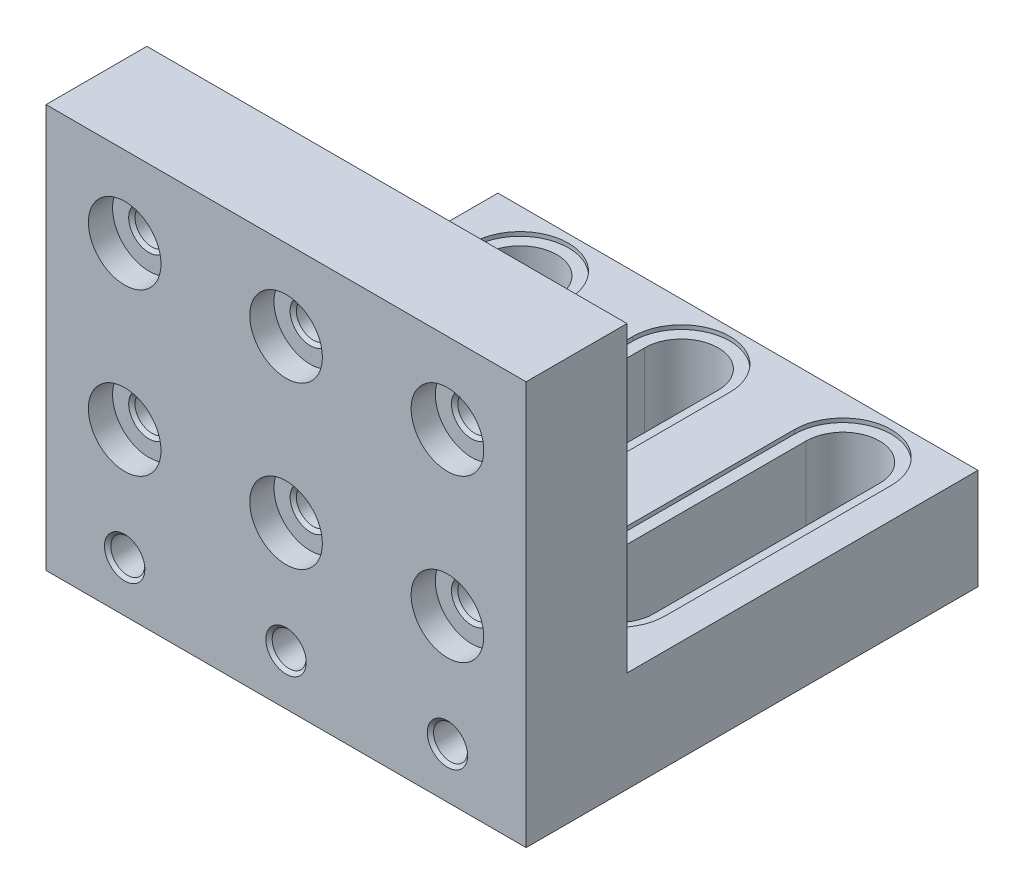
ISO-10303-21;
HEADER;
FILE_DESCRIPTION(('STEP AP214'),'2;1');
FILE_NAME('part.step','',(''),(''),'','','');
FILE_SCHEMA(('AUTOMOTIVE_DESIGN { 1 0 10303 214 1 1 1 1 }'));
ENDSEC;
DATA;
#1=APPLICATION_CONTEXT('core data for automotive mechanical design processes');
#2=APPLICATION_PROTOCOL_DEFINITION('international standard','automotive_design',2000,#1);
#3=PRODUCT_CONTEXT('',#1,'mechanical');
#4=PRODUCT('Part','Part','',(#3));
#5=PRODUCT_RELATED_PRODUCT_CATEGORY('part','',(#4));
#6=PRODUCT_DEFINITION_FORMATION('','',#4);
#7=PRODUCT_DEFINITION_CONTEXT('part definition',#1,'design');
#8=PRODUCT_DEFINITION('design','',#6,#7);
#9=PRODUCT_DEFINITION_SHAPE('','',#8);
#10=(LENGTH_UNIT() NAMED_UNIT(*) SI_UNIT(.MILLI.,.METRE.));
#11=(NAMED_UNIT(*) PLANE_ANGLE_UNIT() SI_UNIT($,.RADIAN.));
#12=(NAMED_UNIT(*) SI_UNIT($,.STERADIAN.) SOLID_ANGLE_UNIT());
#13=UNCERTAINTY_MEASURE_WITH_UNIT(LENGTH_MEASURE(1.E-05),#10,'distance_accuracy_value','');
#14=(GEOMETRIC_REPRESENTATION_CONTEXT(3) GLOBAL_UNCERTAINTY_ASSIGNED_CONTEXT((#13)) GLOBAL_UNIT_ASSIGNED_CONTEXT((#10,
#11,#12)) REPRESENTATION_CONTEXT('',''));
#15=CARTESIAN_POINT('',(0.,0.,0.));
#16=DIRECTION('',(0.,0.,1.));
#17=DIRECTION('',(1.,0.,0.));
#18=AXIS2_PLACEMENT_3D('',#15,#16,#17);
#19=CARTESIAN_POINT('',(-59.5000000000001,0.,42.));
#20=DIRECTION('',(0.,0.,-1.));
#21=DIRECTION('',(-1.,0.,0.));
#22=AXIS2_PLACEMENT_3D('',#19,#20,#21);
#23=PLANE('',#22);
#24=CARTESIAN_POINT('',(-40.,80.0000000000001,42.));
#25=DIRECTION('',(0.,0.,-1.));
#26=DIRECTION('',(1.,0.,0.));
#27=AXIS2_PLACEMENT_3D('',#24,#25,#26);
#28=CIRCLE('',#27,9.);
#29=CARTESIAN_POINT('',(-31.,80.0000000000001,42.));
#30=VERTEX_POINT('',#29);
#31=EDGE_CURVE('E1166',#30,#30,#28,.T.);
#32=ORIENTED_EDGE('',*,*,#31,.T.);
#33=EDGE_LOOP('',(#32));
#34=FACE_BOUND('',#33,.T.);
#35=CARTESIAN_POINT('',(0.,80.0000000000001,42.));
#36=DIRECTION('',(0.,0.,-1.));
#37=DIRECTION('',(1.,0.,0.));
#38=AXIS2_PLACEMENT_3D('',#35,#36,#37);
#39=CIRCLE('',#38,9.);
#40=CARTESIAN_POINT('',(9.00000000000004,80.0000000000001,42.));
#41=VERTEX_POINT('',#40);
#42=EDGE_CURVE('E1104',#41,#41,#39,.T.);
#43=ORIENTED_EDGE('',*,*,#42,.T.);
#44=EDGE_LOOP('',(#43));
#45=FACE_BOUND('',#44,.T.);
#46=CARTESIAN_POINT('',(40.0000000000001,80.0000000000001,42.));
#47=DIRECTION('',(0.,0.,-1.));
#48=DIRECTION('',(1.,0.,0.));
#49=AXIS2_PLACEMENT_3D('',#46,#47,#48);
#50=CIRCLE('',#49,9.);
#51=CARTESIAN_POINT('',(49.0000000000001,80.0000000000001,42.));
#52=VERTEX_POINT('',#51);
#53=EDGE_CURVE('E1042',#52,#52,#50,.T.);
#54=ORIENTED_EDGE('',*,*,#53,.T.);
#55=EDGE_LOOP('',(#54));
#56=FACE_BOUND('',#55,.T.);
#57=CARTESIAN_POINT('',(-40.0000000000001,40.,42.));
#58=DIRECTION('',(0.,0.,-1.));
#59=DIRECTION('',(1.,0.,0.));
#60=AXIS2_PLACEMENT_3D('',#57,#58,#59);
#61=CIRCLE('',#60,9.);
#62=CARTESIAN_POINT('',(-31.,40.,42.));
#63=VERTEX_POINT('',#62);
#64=EDGE_CURVE('E980',#63,#63,#61,.T.);
#65=ORIENTED_EDGE('',*,*,#64,.T.);
#66=EDGE_LOOP('',(#65));
#67=FACE_BOUND('',#66,.T.);
#68=CARTESIAN_POINT('',(0.,40.0000000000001,42.));
#69=DIRECTION('',(0.,0.,-1.));
#70=DIRECTION('',(1.,0.,0.));
#71=AXIS2_PLACEMENT_3D('',#68,#69,#70);
#72=CIRCLE('',#71,9.);
#73=CARTESIAN_POINT('',(9.00000000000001,40.0000000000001,42.));
#74=VERTEX_POINT('',#73);
#75=EDGE_CURVE('E918',#74,#74,#72,.T.);
#76=ORIENTED_EDGE('',*,*,#75,.T.);
#77=EDGE_LOOP('',(#76));
#78=FACE_BOUND('',#77,.T.);
#79=CARTESIAN_POINT('',(40.0000000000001,40.0000000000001,42.));
#80=DIRECTION('',(0.,0.,-1.));
#81=DIRECTION('',(1.,0.,0.));
#82=AXIS2_PLACEMENT_3D('',#79,#80,#81);
#83=CIRCLE('',#82,9.);
#84=CARTESIAN_POINT('',(49.0000000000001,40.0000000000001,42.));
#85=VERTEX_POINT('',#84);
#86=EDGE_CURVE('E856',#85,#85,#83,.T.);
#87=ORIENTED_EDGE('',*,*,#86,.T.);
#88=EDGE_LOOP('',(#87));
#89=FACE_BOUND('',#88,.T.);
#90=CARTESIAN_POINT('',(0.,12.5,42.));
#91=DIRECTION('',(0.,0.,-1.));
#92=DIRECTION('',(-1.,0.,0.));
#93=AXIS2_PLACEMENT_3D('',#90,#91,#92);
#94=CIRCLE('',#93,5.);
#95=CARTESIAN_POINT('',(-5.00000000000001,12.5,42.));
#96=VERTEX_POINT('',#95);
#97=EDGE_CURVE('E713',#96,#96,#94,.T.);
#98=ORIENTED_EDGE('',*,*,#97,.T.);
#99=EDGE_LOOP('',(#98));
#100=FACE_BOUND('',#99,.T.);
#101=DIRECTION('',(0.,1.,0.));
#102=VECTOR('',#101,1.);
#103=CARTESIAN_POINT('',(59.5000000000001,0.,42.));
#104=LINE('',#103,#102);
#105=CARTESIAN_POINT('',(59.5000000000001,0.,42.));
#106=VERTEX_POINT('',#105);
#107=CARTESIAN_POINT('',(59.5000000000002,100.,42.));
#108=VERTEX_POINT('',#107);
#109=EDGE_CURVE('E498',#106,#108,#104,.T.);
#110=ORIENTED_EDGE('',*,*,#109,.T.);
#111=DIRECTION('',(1.,0.,0.));
#112=VECTOR('',#111,1.);
#113=CARTESIAN_POINT('',(-59.5000000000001,100.,42.));
#114=LINE('',#113,#112);
#115=CARTESIAN_POINT('',(-59.5000000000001,100.,42.));
#116=VERTEX_POINT('',#115);
#117=EDGE_CURVE('E544',#116,#108,#114,.T.);
#118=ORIENTED_EDGE('',*,*,#117,.F.);
#119=DIRECTION('',(0.,1.,0.));
#120=VECTOR('',#119,1.);
#121=CARTESIAN_POINT('',(-59.5000000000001,0.,42.));
#122=LINE('',#121,#120);
#123=CARTESIAN_POINT('',(-59.5000000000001,0.,42.));
#124=VERTEX_POINT('',#123);
#125=EDGE_CURVE('E517',#124,#116,#122,.T.);
#126=ORIENTED_EDGE('',*,*,#125,.F.);
#127=DIRECTION('',(1.,0.,0.));
#128=VECTOR('',#127,1.);
#129=CARTESIAN_POINT('',(-59.5000000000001,0.,42.));
#130=LINE('',#129,#128);
#131=EDGE_CURVE('E30',#124,#106,#130,.T.);
#132=ORIENTED_EDGE('',*,*,#131,.T.);
#133=EDGE_LOOP('',(#110,#118,#126,#132));
#134=FACE_BOUND('',#133,.T.);
#135=CARTESIAN_POINT('',(-40.0000000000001,12.5,42.));
#136=DIRECTION('',(0.,0.,-1.));
#137=DIRECTION('',(-1.,0.,0.));
#138=AXIS2_PLACEMENT_3D('',#135,#136,#137);
#139=CIRCLE('',#138,5.);
#140=CARTESIAN_POINT('',(-45.0000000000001,12.5,42.));
#141=VERTEX_POINT('',#140);
#142=EDGE_CURVE('E256',#141,#141,#139,.T.);
#143=ORIENTED_EDGE('',*,*,#142,.T.);
#144=EDGE_LOOP('',(#143));
#145=FACE_BOUND('',#144,.T.);
#146=CARTESIAN_POINT('',(40.0000000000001,12.5000000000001,42.));
#147=DIRECTION('',(0.,0.,-1.));
#148=DIRECTION('',(-1.,0.,0.));
#149=AXIS2_PLACEMENT_3D('',#146,#147,#148);
#150=CIRCLE('',#149,5.);
#151=CARTESIAN_POINT('',(35.0000000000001,12.5000000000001,42.));
#152=VERTEX_POINT('',#151);
#153=EDGE_CURVE('E708',#152,#152,#150,.T.);
#154=ORIENTED_EDGE('',*,*,#153,.T.);
#155=EDGE_LOOP('',(#154));
#156=FACE_BOUND('',#155,.T.);
#157=ADVANCED_FACE('F16',(#34,#45,#56,#67,#78,#89,#100,#134,#145,#156),#23,.F.);
#158=CARTESIAN_POINT('',(40.0000000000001,25.0000000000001,0.));
#159=DIRECTION('',(0.,-1.,0.));
#160=DIRECTION('',(0.,0.,-1.));
#161=AXIS2_PLACEMENT_3D('',#158,#159,#160);
#162=CYLINDRICAL_SURFACE('',#161,9.1);
#163=CARTESIAN_POINT('',(40.0000000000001,24.0000000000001,0.));
#164=DIRECTION('',(0.,1.,0.));
#165=DIRECTION('',(0.,0.,1.));
#166=AXIS2_PLACEMENT_3D('',#163,#164,#165);
#167=CIRCLE('',#166,9.1);
#168=CARTESIAN_POINT('',(30.9,24.0000000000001,0.));
#169=VERTEX_POINT('',#168);
#170=CARTESIAN_POINT('',(49.1000000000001,24.0000000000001,0.));
#171=VERTEX_POINT('',#170);
#172=EDGE_CURVE('E242',#169,#171,#167,.T.);
#173=ORIENTED_EDGE('',*,*,#172,.T.);
#174=DIRECTION('',(0.,-1.,0.));
#175=VECTOR('',#174,1.);
#176=CARTESIAN_POINT('',(49.1000000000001,25.0000000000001,0.));
#177=LINE('',#176,#175);
#178=CARTESIAN_POINT('',(49.1000000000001,0.,0.));
#179=VERTEX_POINT('',#178);
#180=EDGE_CURVE('E307',#171,#179,#177,.T.);
#181=ORIENTED_EDGE('',*,*,#180,.T.);
#182=CARTESIAN_POINT('',(40.0000000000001,0.,0.));
#183=DIRECTION('',(0.,1.,0.));
#184=DIRECTION('',(0.,0.,1.));
#185=AXIS2_PLACEMENT_3D('',#182,#183,#184);
#186=CIRCLE('',#185,9.1);
#187=CARTESIAN_POINT('',(30.9,0.,0.));
#188=VERTEX_POINT('',#187);
#189=EDGE_CURVE('E294',#188,#179,#186,.T.);
#190=ORIENTED_EDGE('',*,*,#189,.F.);
#191=DIRECTION('',(0.,-1.,0.));
#192=VECTOR('',#191,1.);
#193=CARTESIAN_POINT('',(30.9,25.0000000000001,0.));
#194=LINE('',#193,#192);
#195=EDGE_CURVE('E310',#169,#188,#194,.T.);
#196=ORIENTED_EDGE('',*,*,#195,.F.);
#197=EDGE_LOOP('',(#173,#181,#190,#196));
#198=FACE_BOUND('',#197,.T.);
#199=CARTESIAN_POINT('',(35.8118750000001,12.5,8.0789608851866));
#200=CARTESIAN_POINT('',(35.8118759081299,12.3895391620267,8.0789619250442));
#201=CARTESIAN_POINT('',(35.816251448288,12.2790533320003,8.08123432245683));
#202=CARTESIAN_POINT('',(35.8337023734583,12.0589097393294,8.09024454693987));
#203=CARTESIAN_POINT('',(35.8467826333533,11.9492524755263,8.09698487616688));
#204=CARTESIAN_POINT('',(35.881519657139,11.7314366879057,8.11470895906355));
#205=CARTESIAN_POINT('',(35.9031923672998,11.6232813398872,8.1257006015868));
#206=CARTESIAN_POINT('',(35.9548577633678,11.4094321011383,8.15154278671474));
#207=CARTESIAN_POINT('',(35.9848540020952,11.3037392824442,8.16639497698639));
#208=CARTESIAN_POINT('',(36.0865387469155,10.9924854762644,8.21587105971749));
#209=CARTESIAN_POINT('',(36.1701308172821,10.7914741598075,8.25552729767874));
#210=CARTESIAN_POINT('',(36.3662229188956,10.4064805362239,8.34368908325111));
#211=CARTESIAN_POINT('',(36.4787204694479,10.2224967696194,8.39219387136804));
#212=CARTESIAN_POINT('',(36.7385973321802,9.86252545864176,8.49671697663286));
#213=CARTESIAN_POINT('',(36.8878541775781,9.68797649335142,8.55302305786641));
#214=CARTESIAN_POINT('',(37.2132191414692,9.36524050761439,8.66448732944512));
#215=CARTESIAN_POINT('',(37.3893389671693,9.21706504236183,8.71964500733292));
#216=CARTESIAN_POINT('',(37.6759323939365,9.01375911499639,8.79882497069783));
#217=CARTESIAN_POINT('',(37.778166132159,8.94771704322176,8.82525736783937));
#218=CARTESIAN_POINT('',(37.9884556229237,8.8245535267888,8.87554794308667));
#219=CARTESIAN_POINT('',(38.0965089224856,8.76742836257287,8.89940719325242));
#220=CARTESIAN_POINT('',(38.3177525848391,8.66262820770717,8.94386827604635));
#221=CARTESIAN_POINT('',(38.4309431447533,8.61495358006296,8.96446998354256));
#222=CARTESIAN_POINT('',(38.6615908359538,8.52958937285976,9.0017939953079));
#223=CARTESIAN_POINT('',(38.7790456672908,8.49189449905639,9.01851835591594));
#224=CARTESIAN_POINT('',(39.0100076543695,8.42891394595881,9.04669043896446));
#225=CARTESIAN_POINT('',(39.1233140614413,8.40300820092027,9.05839920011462));
#226=CARTESIAN_POINT('',(39.3519862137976,8.36067861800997,9.07762271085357));
#227=CARTESIAN_POINT('',(39.467350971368,8.34425035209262,9.08513941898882));
#228=CARTESIAN_POINT('',(39.6992266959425,8.32106481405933,9.09576834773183));
#229=CARTESIAN_POINT('',(39.815737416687,8.31430550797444,9.09888149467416));
#230=CARTESIAN_POINT('',(40.048945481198,8.31053757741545,9.10061545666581));
#231=CARTESIAN_POINT('',(40.1656428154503,8.31352847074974,9.09923649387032));
#232=CARTESIAN_POINT('',(40.3896049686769,8.32864050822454,9.09229381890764));
#233=CARTESIAN_POINT('',(40.4969268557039,8.34006731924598,9.08704839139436));
#234=CARTESIAN_POINT('',(40.7101430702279,8.37111212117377,9.07287953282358));
#235=CARTESIAN_POINT('',(40.816036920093,8.39073278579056,9.06395490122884));
#236=CARTESIAN_POINT('',(41.1304051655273,8.4616086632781,9.0319633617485));
#237=CARTESIAN_POINT('',(41.3357787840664,8.5248925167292,9.00367161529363));
#238=CARTESIAN_POINT('',(41.7356958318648,8.68231459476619,8.93528200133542));
#239=CARTESIAN_POINT('',(41.9300299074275,8.77690257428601,8.89501296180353));
#240=CARTESIAN_POINT('',(42.3006060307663,8.99376248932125,8.8064479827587));
#241=CARTESIAN_POINT('',(42.476841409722,9.11604457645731,8.75814910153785));
#242=CARTESIAN_POINT('',(42.8217712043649,9.39653759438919,8.65348250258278));
#243=CARTESIAN_POINT('',(42.9886187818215,9.55689112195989,8.59677779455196));
#244=CARTESIAN_POINT('',(43.2940197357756,9.9032517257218,8.48445323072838));
#245=CARTESIAN_POINT('',(43.4325570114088,10.0892732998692,8.4288340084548));
#246=CARTESIAN_POINT('',(43.6193155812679,10.3891382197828,8.34957706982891));
#247=CARTESIAN_POINT('',(43.6791496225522,10.4952195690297,8.32331230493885));
#248=CARTESIAN_POINT('',(43.7895684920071,10.7127079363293,8.27362264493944));
#249=CARTESIAN_POINT('',(43.8401574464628,10.8241125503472,8.25019648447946));
#250=CARTESIAN_POINT('',(43.93157625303,11.0515124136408,8.2070254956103));
#251=CARTESIAN_POINT('',(43.9724085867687,11.1675064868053,8.18727973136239));
#252=CARTESIAN_POINT('',(44.0438318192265,11.4032027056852,8.15223953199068));
#253=CARTESIAN_POINT('',(44.0744285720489,11.5229026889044,8.13694255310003));
#254=CARTESIAN_POINT('',(44.123139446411,11.7561893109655,8.11236152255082));
#255=CARTESIAN_POINT('',(44.1420034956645,11.8695818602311,8.10271922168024));
#256=CARTESIAN_POINT('',(44.1703508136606,12.0977856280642,8.08816604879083));
#257=CARTESIAN_POINT('',(44.1798386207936,12.2125961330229,8.08325288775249));
#258=CARTESIAN_POINT('',(44.189315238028,12.4426898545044,8.0783455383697));
#259=CARTESIAN_POINT('',(44.1893060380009,12.5579729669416,8.07835031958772));
#260=CARTESIAN_POINT('',(44.1797943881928,12.7880358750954,8.08327577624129));
#261=CARTESIAN_POINT('',(44.1702923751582,12.9028156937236,8.08819622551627));
#262=CARTESIAN_POINT('',(44.1431454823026,13.1211045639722,8.10213277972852));
#263=CARTESIAN_POINT('',(44.1262700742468,13.2247349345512,8.1107608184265));
#264=CARTESIAN_POINT('',(44.0848871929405,13.4300944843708,8.13168038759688));
#265=CARTESIAN_POINT('',(44.0603772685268,13.5318230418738,8.14397309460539));
#266=CARTESIAN_POINT('',(43.9757423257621,13.833158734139,8.1858104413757));
#267=CARTESIAN_POINT('',(43.9044924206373,14.0290713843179,8.22032509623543));
#268=CARTESIAN_POINT('',(43.7308939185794,14.4151319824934,8.30059763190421));
#269=CARTESIAN_POINT('',(43.6272730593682,14.6046074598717,8.34679719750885));
#270=CARTESIAN_POINT('',(43.3930191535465,14.9645348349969,8.44473332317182));
#271=CARTESIAN_POINT('',(43.2623729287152,15.1349773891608,8.49647257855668));
#272=CARTESIAN_POINT('',(42.9619869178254,15.4703239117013,8.60608830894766));
#273=CARTESIAN_POINT('',(42.789602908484,15.6328370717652,8.66404666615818));
#274=CARTESIAN_POINT('',(42.4187036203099,15.9272777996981,8.77480487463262));
#275=CARTESIAN_POINT('',(42.2201834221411,16.0591995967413,8.82760375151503));
#276=CARTESIAN_POINT('',(41.9051272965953,16.2316920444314,8.89900992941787));
#277=CARTESIAN_POINT('',(41.7964221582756,16.2852357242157,8.92164113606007));
#278=CARTESIAN_POINT('',(41.5742433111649,16.3828917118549,8.96350952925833));
#279=CARTESIAN_POINT('',(41.4607717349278,16.4270081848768,8.98274821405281));
#280=CARTESIAN_POINT('',(41.2299182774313,16.5053150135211,9.01725698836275));
#281=CARTESIAN_POINT('',(41.1125378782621,16.539509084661,9.03252856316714));
#282=CARTESIAN_POINT('',(40.8747695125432,16.5975772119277,9.05864633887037));
#283=CARTESIAN_POINT('',(40.7543818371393,16.6214522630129,9.06949296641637));
#284=CARTESIAN_POINT('',(40.521611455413,16.6570443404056,9.08572500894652));
#285=CARTESIAN_POINT('',(40.4093820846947,16.6695979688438,9.09148539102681));
#286=CARTESIAN_POINT('',(40.1840978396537,16.6856007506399,9.09883570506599));
#287=CARTESIAN_POINT('',(40.0710427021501,16.6890468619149,9.10042424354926));
#288=CARTESIAN_POINT('',(39.8451134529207,16.6867835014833,9.09938262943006));
#289=CARTESIAN_POINT('',(39.7322392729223,16.6810795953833,9.09675504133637));
#290=CARTESIAN_POINT('',(39.5074516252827,16.6605925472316,9.08735698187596));
#291=CARTESIAN_POINT('',(39.3955385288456,16.645806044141,9.08058497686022));
#292=CARTESIAN_POINT('',(39.1791734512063,16.6082929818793,9.06352111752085));
#293=CARTESIAN_POINT('',(39.0746299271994,16.5860047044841,9.0534241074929));
#294=CARTESIAN_POINT('',(38.8678872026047,16.5336214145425,9.02990424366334));
#295=CARTESIAN_POINT('',(38.7656888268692,16.5035236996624,9.01648023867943));
#296=CARTESIAN_POINT('',(38.4636330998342,16.4019231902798,8.97166989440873));
#297=CARTESIAN_POINT('',(38.2681343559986,16.3190812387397,8.93573018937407));
#298=CARTESIAN_POINT('',(37.8848717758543,16.1215035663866,8.853050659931));
#299=CARTESIAN_POINT('',(37.6978669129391,16.0054859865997,8.80589315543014));
#300=CARTESIAN_POINT('',(37.3451262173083,15.7465245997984,8.70604799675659));
#301=CARTESIAN_POINT('',(37.1793998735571,15.6035688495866,8.65335789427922));
#302=CARTESIAN_POINT('',(36.8592412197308,15.2806569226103,8.54264142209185));
#303=CARTESIAN_POINT('',(36.7069607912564,15.0985903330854,8.48454165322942));
#304=CARTESIAN_POINT('',(36.4345040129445,14.70994987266,8.37370544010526));
#305=CARTESIAN_POINT('',(36.3143495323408,14.5033594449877,8.32097266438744));
#306=CARTESIAN_POINT('',(36.1607109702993,14.1777717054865,8.25064084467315));
#307=CARTESIAN_POINT('',(36.1137374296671,14.0659323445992,8.22855639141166));
#308=CARTESIAN_POINT('',(36.0294999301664,13.8380037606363,8.18824234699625));
#309=CARTESIAN_POINT('',(35.9922310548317,13.7219167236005,8.17001080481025));
#310=CARTESIAN_POINT('',(35.927933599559,13.4866631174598,8.13815465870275));
#311=CARTESIAN_POINT('',(35.9008782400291,13.3675054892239,8.12451801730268));
#312=CARTESIAN_POINT('',(35.8572540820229,13.1268777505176,8.1023614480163));
#313=CARTESIAN_POINT('',(35.8406775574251,13.0054094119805,8.09383775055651));
#314=CARTESIAN_POINT('',(35.8236035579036,12.8196847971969,8.08503241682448));
#315=CARTESIAN_POINT('',(35.8192076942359,12.755853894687,8.08275857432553));
#316=CARTESIAN_POINT('',(35.813343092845,12.6280181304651,8.07972247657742));
#317=CARTESIAN_POINT('',(35.811874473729,12.5640132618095,8.07896028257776));
#318=CARTESIAN_POINT('',(35.8118750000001,12.5,8.0789608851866));
#319=B_SPLINE_CURVE_WITH_KNOTS('',3,(#199,#200,#201,#202,#203,#204,#205,#206,#207,#208,#209,
#210,#211,#212,#213,#214,#215,#216,#217,#218,#219,#220,#221,#222,#223,#224,#225,#226,#227,#228,
#229,#230,#231,#232,#233,#234,#235,#236,#237,#238,#239,#240,#241,#242,#243,#244,#245,#246,#247,
#248,#249,#250,#251,#252,#253,#254,#255,#256,#257,#258,#259,#260,#261,#262,#263,#264,#265,#266,
#267,#268,#269,#270,#271,#272,#273,#274,#275,#276,#277,#278,#279,#280,#281,#282,#283,#284,#285,
#286,#287,#288,#289,#290,#291,#292,#293,#294,#295,#296,#297,#298,#299,#300,#301,#302,#303,#304,
#305,#306,#307,#308,#309,#310,#311,#312,#313,#314,#315,#316,#317,#318),.UNSPECIFIED.,.T.,.F.,(4,
2,2,2,2,2,2,2,2,2,2,2,2,2,2,2,2,2,2,2,2,2,2,2,2,2,2,2,2,2,2,2,2,2,2,2,2,2,2,2,2,2,2,2,2,2,2,2,2,
2,2,2,2,2,2,2,2,2,2,4),(0.,0.331316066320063,0.662817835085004,0.994937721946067,
1.32719958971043,1.98788249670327,2.64850872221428,3.35493331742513,4.06166666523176,
4.43490476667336,4.80798675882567,5.18108307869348,5.55398107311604,5.9039711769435,
6.25379762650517,6.60355047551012,6.95328602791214,7.27705652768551,7.60093275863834,
8.24805373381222,8.90490785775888,9.56200315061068,10.2737596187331,10.9859197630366,
11.3592899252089,11.7324930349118,12.1056011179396,12.4784954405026,12.8240871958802,
13.1695115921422,13.5148636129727,13.8601997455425,14.1758755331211,14.4916527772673,
15.1227415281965,15.7826673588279,16.4429157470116,17.1713661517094,17.8999538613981,
18.2693548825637,18.638592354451,19.0076913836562,19.3767548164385,19.7155469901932,
20.0544523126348,20.3931515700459,20.7319762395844,21.0537046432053,21.3755445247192,
22.0186782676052,22.691132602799,23.3638857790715,24.0937294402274,24.8240686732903,
25.193536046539,25.5628158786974,25.9311206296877,26.2991535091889,26.4911470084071,
26.6831482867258),.UNSPECIFIED.);
#320=CARTESIAN_POINT('',(35.8118750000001,12.5,8.0789608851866));
#321=VERTEX_POINT('',#320);
#322=EDGE_CURVE('E20',#321,#321,#319,.T.);
#323=ORIENTED_EDGE('',*,*,#322,.T.);
#324=EDGE_LOOP('',(#323));
#325=FACE_BOUND('',#324,.T.);
#326=ADVANCED_FACE('F591',(#198,#325),#162,.F.);
#327=CARTESIAN_POINT('',(0.,25.0000000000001,0.));
#328=DIRECTION('',(0.,-1.,0.));
#329=DIRECTION('',(0.,0.,-1.));
#330=AXIS2_PLACEMENT_3D('',#327,#328,#329);
#331=CYLINDRICAL_SURFACE('',#330,9.1);
#332=CARTESIAN_POINT('',(0.,24.0000000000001,0.));
#333=DIRECTION('',(0.,1.,0.));
#334=DIRECTION('',(0.,0.,1.));
#335=AXIS2_PLACEMENT_3D('',#332,#333,#334);
#336=CIRCLE('',#335,9.1);
#337=CARTESIAN_POINT('',(-9.1,24.0000000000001,0.));
#338=VERTEX_POINT('',#337);
#339=CARTESIAN_POINT('',(9.1,24.0000000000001,0.));
#340=VERTEX_POINT('',#339);
#341=EDGE_CURVE('E362',#338,#340,#336,.T.);
#342=ORIENTED_EDGE('',*,*,#341,.T.);
#343=DIRECTION('',(0.,-1.,0.));
#344=VECTOR('',#343,1.);
#345=CARTESIAN_POINT('',(9.1,25.0000000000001,0.));
#346=LINE('',#345,#344);
#347=CARTESIAN_POINT('',(9.1,0.,0.));
#348=VERTEX_POINT('',#347);
#349=EDGE_CURVE('E394',#340,#348,#346,.T.);
#350=ORIENTED_EDGE('',*,*,#349,.T.);
#351=CARTESIAN_POINT('',(0.,0.,0.));
#352=DIRECTION('',(0.,1.,0.));
#353=DIRECTION('',(0.,0.,1.));
#354=AXIS2_PLACEMENT_3D('',#351,#352,#353);
#355=CIRCLE('',#354,9.1);
#356=CARTESIAN_POINT('',(-9.10000000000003,0.,0.));
#357=VERTEX_POINT('',#356);
#358=EDGE_CURVE('E379',#357,#348,#355,.T.);
#359=ORIENTED_EDGE('',*,*,#358,.F.);
#360=DIRECTION('',(0.,-1.,0.));
#361=VECTOR('',#360,1.);
#362=CARTESIAN_POINT('',(-9.1,25.0000000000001,0.));
#363=LINE('',#362,#361);
#364=EDGE_CURVE('E397',#338,#357,#363,.T.);
#365=ORIENTED_EDGE('',*,*,#364,.F.);
#366=EDGE_LOOP('',(#342,#350,#359,#365));
#367=FACE_BOUND('',#366,.T.);
#368=CARTESIAN_POINT('',(-4.188125,12.5,8.0789608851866));
#369=CARTESIAN_POINT('',(-4.18812409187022,12.3895391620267,8.0789619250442));
#370=CARTESIAN_POINT('',(-4.18374855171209,12.2790533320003,8.08123432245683));
#371=CARTESIAN_POINT('',(-4.16629762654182,12.0589097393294,8.09024454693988));
#372=CARTESIAN_POINT('',(-4.15321736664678,11.9492524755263,8.09698487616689));
#373=CARTESIAN_POINT('',(-4.11848034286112,11.7314366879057,8.11470895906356));
#374=CARTESIAN_POINT('',(-4.09680763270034,11.6232813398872,8.12570060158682));
#375=CARTESIAN_POINT('',(-4.04514223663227,11.4094321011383,8.15154278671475));
#376=CARTESIAN_POINT('',(-4.01514599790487,11.3037392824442,8.1663949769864));
#377=CARTESIAN_POINT('',(-3.9134612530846,10.9924854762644,8.21587105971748));
#378=CARTESIAN_POINT('',(-3.82986918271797,10.7914741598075,8.25552729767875));
#379=CARTESIAN_POINT('',(-3.63377708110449,10.4064805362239,8.34368908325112));
#380=CARTESIAN_POINT('',(-3.52127953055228,10.2224967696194,8.39219387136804));
#381=CARTESIAN_POINT('',(-3.26140266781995,9.86252545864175,8.49671697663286));
#382=CARTESIAN_POINT('',(-3.11214582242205,9.68797649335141,8.55302305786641));
#383=CARTESIAN_POINT('',(-2.78678085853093,9.36524050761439,8.66448732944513));
#384=CARTESIAN_POINT('',(-2.61066103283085,9.21706504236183,8.71964500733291));
#385=CARTESIAN_POINT('',(-2.32406760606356,9.01375911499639,8.79882497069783));
#386=CARTESIAN_POINT('',(-2.22183386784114,8.94771704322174,8.82525736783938));
#387=CARTESIAN_POINT('',(-2.01154437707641,8.82455352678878,8.87554794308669));
#388=CARTESIAN_POINT('',(-1.90349107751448,8.76742836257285,8.89940719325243));
#389=CARTESIAN_POINT('',(-1.682247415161,8.66262820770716,8.94386827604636));
#390=CARTESIAN_POINT('',(-1.56905685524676,8.61495358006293,8.96446998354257));
#391=CARTESIAN_POINT('',(-1.33840916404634,8.52958937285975,9.00179399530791));
#392=CARTESIAN_POINT('',(-1.22095433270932,8.4918944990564,9.01851835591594));
#393=CARTESIAN_POINT('',(-0.98999234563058,8.4289139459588,9.04669043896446));
#394=CARTESIAN_POINT('',(-0.876685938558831,8.40300820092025,9.05839920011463));
#395=CARTESIAN_POINT('',(-0.648013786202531,8.36067861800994,9.07762271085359));
#396=CARTESIAN_POINT('',(-0.532649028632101,8.34425035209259,9.08513941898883));
#397=CARTESIAN_POINT('',(-0.300773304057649,8.3210648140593,9.09576834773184));
#398=CARTESIAN_POINT('',(-0.184262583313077,8.31430550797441,9.09888149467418));
#399=CARTESIAN_POINT('',(0.048945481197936,8.31053757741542,9.10061545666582));
#400=CARTESIAN_POINT('',(0.165642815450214,8.31352847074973,9.09923649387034));
#401=CARTESIAN_POINT('',(0.389604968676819,8.32864050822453,9.09229381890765));
#402=CARTESIAN_POINT('',(0.496926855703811,8.34006731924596,9.08704839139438));
#403=CARTESIAN_POINT('',(0.710143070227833,8.37111212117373,9.0728795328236));
#404=CARTESIAN_POINT('',(0.816036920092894,8.39073278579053,9.06395490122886));
#405=CARTESIAN_POINT('',(1.13040516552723,8.46160866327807,9.03196336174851));
#406=CARTESIAN_POINT('',(1.33577878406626,8.52489251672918,9.00367161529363));
#407=CARTESIAN_POINT('',(1.73569583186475,8.68231459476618,8.93528200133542));
#408=CARTESIAN_POINT('',(1.93002990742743,8.77690257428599,8.89501296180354));
#409=CARTESIAN_POINT('',(2.30060603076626,8.99376248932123,8.80644798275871));
#410=CARTESIAN_POINT('',(2.47684140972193,9.11604457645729,8.75814910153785));
#411=CARTESIAN_POINT('',(2.82177120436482,9.39653759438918,8.65348250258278));
#412=CARTESIAN_POINT('',(2.98861878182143,9.55689112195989,8.59677779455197));
#413=CARTESIAN_POINT('',(3.29401973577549,9.90325172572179,8.48445323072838));
#414=CARTESIAN_POINT('',(3.43255701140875,10.0892732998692,8.42883400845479));
#415=CARTESIAN_POINT('',(3.61931558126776,10.3891382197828,8.34957706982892));
#416=CARTESIAN_POINT('',(3.67914962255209,10.4952195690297,8.32331230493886));
#417=CARTESIAN_POINT('',(3.78956849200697,10.7127079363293,8.27362264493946));
#418=CARTESIAN_POINT('',(3.84015744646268,10.8241125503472,8.25019648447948));
#419=CARTESIAN_POINT('',(3.93157625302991,11.0515124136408,8.20702549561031));
#420=CARTESIAN_POINT('',(3.97240858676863,11.1675064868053,8.1872797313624));
#421=CARTESIAN_POINT('',(4.04383181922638,11.4032027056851,8.15223953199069));
#422=CARTESIAN_POINT('',(4.07442857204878,11.5229026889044,8.13694255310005));
#423=CARTESIAN_POINT('',(4.12313944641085,11.7561893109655,8.11236152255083));
#424=CARTESIAN_POINT('',(4.14200349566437,11.8695818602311,8.10271922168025));
#425=CARTESIAN_POINT('',(4.17035081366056,12.0977856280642,8.08816604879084));
#426=CARTESIAN_POINT('',(4.1798386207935,12.2125961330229,8.0832528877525));
#427=CARTESIAN_POINT('',(4.18931523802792,12.4426898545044,8.07834553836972));
#428=CARTESIAN_POINT('',(4.18930603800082,12.5579729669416,8.07835031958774));
#429=CARTESIAN_POINT('',(4.17979438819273,12.7880358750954,8.08327577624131));
#430=CARTESIAN_POINT('',(4.17029237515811,12.9028156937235,8.08819622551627));
#431=CARTESIAN_POINT('',(4.14314548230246,13.1211045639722,8.10213277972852));
#432=CARTESIAN_POINT('',(4.12627007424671,13.2247349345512,8.11076081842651));
#433=CARTESIAN_POINT('',(4.0848871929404,13.4300944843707,8.1316803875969));
#434=CARTESIAN_POINT('',(4.06037726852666,13.5318230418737,8.14397309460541));
#435=CARTESIAN_POINT('',(3.97574232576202,13.8331587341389,8.1858104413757));
#436=CARTESIAN_POINT('',(3.90449242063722,14.0290713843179,8.22032509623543));
#437=CARTESIAN_POINT('',(3.73089391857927,14.4151319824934,8.30059763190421));
#438=CARTESIAN_POINT('',(3.62727305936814,14.6046074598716,8.34679719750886));
#439=CARTESIAN_POINT('',(3.39301915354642,14.9645348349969,8.44473332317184));
#440=CARTESIAN_POINT('',(3.26237292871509,15.1349773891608,8.49647257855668));
#441=CARTESIAN_POINT('',(2.96198691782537,15.4703239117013,8.60608830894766));
#442=CARTESIAN_POINT('',(2.78960290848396,15.6328370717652,8.6640466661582));
#443=CARTESIAN_POINT('',(2.41870362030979,15.9272777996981,8.77480487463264));
#444=CARTESIAN_POINT('',(2.22018342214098,16.0591995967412,8.82760375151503));
#445=CARTESIAN_POINT('',(1.90512729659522,16.2316920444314,8.89900992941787));
#446=CARTESIAN_POINT('',(1.79642215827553,16.2852357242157,8.92164113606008));
#447=CARTESIAN_POINT('',(1.57424331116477,16.3828917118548,8.96350952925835));
#448=CARTESIAN_POINT('',(1.46077173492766,16.4270081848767,8.98274821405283));
#449=CARTESIAN_POINT('',(1.22991827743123,16.505315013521,9.01725698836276));
#450=CARTESIAN_POINT('',(1.112537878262,16.539509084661,9.03252856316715));
#451=CARTESIAN_POINT('',(0.874769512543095,16.5975772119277,9.05864633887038));
#452=CARTESIAN_POINT('',(0.754381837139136,16.6214522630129,9.06949296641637));
#453=CARTESIAN_POINT('',(0.521611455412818,16.6570443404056,9.08572500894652));
#454=CARTESIAN_POINT('',(0.409382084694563,16.6695979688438,9.09148539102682));
#455=CARTESIAN_POINT('',(0.184097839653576,16.6856007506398,9.09883570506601));
#456=CARTESIAN_POINT('',(0.0710427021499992,16.6890468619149,9.10042424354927));
#457=CARTESIAN_POINT('',(-0.154886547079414,16.6867835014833,9.09938262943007));
#458=CARTESIAN_POINT('',(-0.267760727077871,16.6810795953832,9.09675504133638));
#459=CARTESIAN_POINT('',(-0.492548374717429,16.6605925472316,9.08735698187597));
#460=CARTESIAN_POINT('',(-0.604461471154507,16.645806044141,9.08058497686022));
#461=CARTESIAN_POINT('',(-0.820826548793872,16.6082929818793,9.06352111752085));
#462=CARTESIAN_POINT('',(-0.925370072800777,16.5860047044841,9.05342410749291));
#463=CARTESIAN_POINT('',(-1.13211279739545,16.5336214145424,9.02990424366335));
#464=CARTESIAN_POINT('',(-1.23431117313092,16.5035236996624,9.01648023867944));
#465=CARTESIAN_POINT('',(-1.5363669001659,16.4019231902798,8.97166989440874));
#466=CARTESIAN_POINT('',(-1.73186564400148,16.3190812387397,8.93573018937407));
#467=CARTESIAN_POINT('',(-2.11512822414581,16.1215035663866,8.853050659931));
#468=CARTESIAN_POINT('',(-2.30213308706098,16.0054859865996,8.80589315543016));
#469=CARTESIAN_POINT('',(-2.6548737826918,15.7465245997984,8.70604799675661));
#470=CARTESIAN_POINT('',(-2.82060012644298,15.6035688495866,8.65335789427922));
#471=CARTESIAN_POINT('',(-3.14075878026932,15.2806569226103,8.54264142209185));
#472=CARTESIAN_POINT('',(-3.29303920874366,15.0985903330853,8.48454165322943));
#473=CARTESIAN_POINT('',(-3.56549598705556,14.70994987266,8.37370544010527));
#474=CARTESIAN_POINT('',(-3.68565046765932,14.5033594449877,8.32097266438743));
#475=CARTESIAN_POINT('',(-3.83928902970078,14.1777717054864,8.25064084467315));
#476=CARTESIAN_POINT('',(-3.886262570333,14.0659323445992,8.22855639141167));
#477=CARTESIAN_POINT('',(-3.97050006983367,13.8380037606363,8.18824234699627));
#478=CARTESIAN_POINT('',(-4.00776894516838,13.7219167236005,8.17001080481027));
#479=CARTESIAN_POINT('',(-4.07206640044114,13.4866631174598,8.13815465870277));
#480=CARTESIAN_POINT('',(-4.09912175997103,13.3675054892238,8.1245180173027));
#481=CARTESIAN_POINT('',(-4.14274591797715,13.1268777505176,8.10236144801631));
#482=CARTESIAN_POINT('',(-4.15932244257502,13.0054094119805,8.09383775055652));
#483=CARTESIAN_POINT('',(-4.17639644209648,12.8196847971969,8.0850324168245));
#484=CARTESIAN_POINT('',(-4.18079230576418,12.755853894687,8.08275857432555));
#485=CARTESIAN_POINT('',(-4.18665690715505,12.6280181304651,8.07972247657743));
#486=CARTESIAN_POINT('',(-4.18812552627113,12.5640132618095,8.07896028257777));
#487=CARTESIAN_POINT('',(-4.188125,12.5,8.0789608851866));
#488=B_SPLINE_CURVE_WITH_KNOTS('',3,(#368,#369,#370,#371,#372,#373,#374,#375,#376,#377,#378,
#379,#380,#381,#382,#383,#384,#385,#386,#387,#388,#389,#390,#391,#392,#393,#394,#395,#396,#397,
#398,#399,#400,#401,#402,#403,#404,#405,#406,#407,#408,#409,#410,#411,#412,#413,#414,#415,#416,
#417,#418,#419,#420,#421,#422,#423,#424,#425,#426,#427,#428,#429,#430,#431,#432,#433,#434,#435,
#436,#437,#438,#439,#440,#441,#442,#443,#444,#445,#446,#447,#448,#449,#450,#451,#452,#453,#454,
#455,#456,#457,#458,#459,#460,#461,#462,#463,#464,#465,#466,#467,#468,#469,#470,#471,#472,#473,
#474,#475,#476,#477,#478,#479,#480,#481,#482,#483,#484,#485,#486,#487),.UNSPECIFIED.,.T.,.F.,(4,
2,2,2,2,2,2,2,2,2,2,2,2,2,2,2,2,2,2,2,2,2,2,2,2,2,2,2,2,2,2,2,2,2,2,2,2,2,2,2,2,2,2,2,2,2,2,2,2,
2,2,2,2,2,2,2,2,2,2,4),(0.,0.33131606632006,0.662817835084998,0.994937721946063,
1.32719958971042,1.98788249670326,2.64850872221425,3.35493331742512,4.06166666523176,
4.43490476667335,4.80798675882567,5.18108307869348,5.55398107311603,5.9039711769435,
6.25379762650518,6.60355047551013,6.95328602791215,7.27705652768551,7.60093275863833,
8.24805373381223,8.90490785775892,9.56200315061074,10.2737596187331,10.9859197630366,
11.359289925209,11.7324930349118,12.1056011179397,12.4784954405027,12.8240871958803,
13.1695115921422,13.5148636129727,13.8601997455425,14.1758755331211,14.4916527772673,
15.1227415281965,15.7826673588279,16.4429157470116,17.1713661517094,17.8999538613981,
18.2693548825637,18.638592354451,19.0076913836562,19.3767548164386,19.7155469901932,
20.0544523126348,20.3931515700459,20.7319762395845,21.0537046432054,21.3755445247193,
22.0186782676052,22.691132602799,23.3638857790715,24.0937294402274,24.8240686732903,
25.193536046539,25.5628158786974,25.9311206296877,26.2991535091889,26.4911470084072,
26.6831482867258),.UNSPECIFIED.);
#489=CARTESIAN_POINT('',(-4.188125,12.5,8.0789608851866));
#490=VERTEX_POINT('',#489);
#491=EDGE_CURVE('E554',#490,#490,#488,.T.);
#492=ORIENTED_EDGE('',*,*,#491,.T.);
#493=EDGE_LOOP('',(#492));
#494=FACE_BOUND('',#493,.T.);
#495=ADVANCED_FACE('F595',(#367,#494),#331,.F.);
#496=CARTESIAN_POINT('',(-40.0000000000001,25.,0.));
#497=DIRECTION('',(0.,-1.,0.));
#498=DIRECTION('',(0.,0.,-1.));
#499=AXIS2_PLACEMENT_3D('',#496,#497,#498);
#500=CYLINDRICAL_SURFACE('',#499,9.1);
#501=CARTESIAN_POINT('',(-40.0000000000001,24.,0.));
#502=DIRECTION('',(0.,1.,0.));
#503=DIRECTION('',(0.,0.,1.));
#504=AXIS2_PLACEMENT_3D('',#501,#502,#503);
#505=CIRCLE('',#504,9.1);
#506=CARTESIAN_POINT('',(-49.1000000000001,24.,0.));
#507=VERTEX_POINT('',#506);
#508=CARTESIAN_POINT('',(-30.9000000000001,24.,0.));
#509=VERTEX_POINT('',#508);
#510=EDGE_CURVE('E449',#507,#509,#505,.T.);
#511=ORIENTED_EDGE('',*,*,#510,.T.);
#512=DIRECTION('',(0.,-1.,0.));
#513=VECTOR('',#512,1.);
#514=CARTESIAN_POINT('',(-30.9000000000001,25.,0.));
#515=LINE('',#514,#513);
#516=CARTESIAN_POINT('',(-30.9000000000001,0.,0.));
#517=VERTEX_POINT('',#516);
#518=EDGE_CURVE('E481',#509,#517,#515,.T.);
#519=ORIENTED_EDGE('',*,*,#518,.T.);
#520=CARTESIAN_POINT('',(-40.0000000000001,0.,0.));
#521=DIRECTION('',(0.,1.,0.));
#522=DIRECTION('',(0.,0.,1.));
#523=AXIS2_PLACEMENT_3D('',#520,#521,#522);
#524=CIRCLE('',#523,9.1);
#525=CARTESIAN_POINT('',(-49.1000000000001,0.,0.));
#526=VERTEX_POINT('',#525);
#527=EDGE_CURVE('E466',#526,#517,#524,.T.);
#528=ORIENTED_EDGE('',*,*,#527,.F.);
#529=DIRECTION('',(0.,-1.,0.));
#530=VECTOR('',#529,1.);
#531=CARTESIAN_POINT('',(-49.1000000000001,25.,0.));
#532=LINE('',#531,#530);
#533=EDGE_CURVE('E484',#507,#526,#532,.T.);
#534=ORIENTED_EDGE('',*,*,#533,.F.);
#535=EDGE_LOOP('',(#511,#519,#528,#534));
#536=FACE_BOUND('',#535,.T.);
#537=CARTESIAN_POINT('',(-44.1881250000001,12.5,8.07896088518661));
#538=CARTESIAN_POINT('',(-44.1881240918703,12.3895391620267,8.07896192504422));
#539=CARTESIAN_POINT('',(-44.1837485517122,12.2790533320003,8.08123432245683));
#540=CARTESIAN_POINT('',(-44.1662976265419,12.0589097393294,8.09024454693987));
#541=CARTESIAN_POINT('',(-44.1532173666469,11.9492524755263,8.09698487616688));
#542=CARTESIAN_POINT('',(-44.1184803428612,11.7314366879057,8.11470895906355));
#543=CARTESIAN_POINT('',(-44.0968076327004,11.6232813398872,8.1257006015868));
#544=CARTESIAN_POINT('',(-44.0451422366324,11.4094321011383,8.15154278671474));
#545=CARTESIAN_POINT('',(-44.015145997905,11.3037392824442,8.16639497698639));
#546=CARTESIAN_POINT('',(-43.9134612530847,10.9924854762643,8.21587105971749));
#547=CARTESIAN_POINT('',(-43.829869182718,10.7914741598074,8.25552729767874));
#548=CARTESIAN_POINT('',(-43.6337770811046,10.4064805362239,8.34368908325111));
#549=CARTESIAN_POINT('',(-43.5212795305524,10.2224967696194,8.39219387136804));
#550=CARTESIAN_POINT('',(-43.2614026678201,9.86252545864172,8.49671697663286));
#551=CARTESIAN_POINT('',(-43.1121458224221,9.68797649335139,8.5530230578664));
#552=CARTESIAN_POINT('',(-42.786780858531,9.36524050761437,8.66448732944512));
#553=CARTESIAN_POINT('',(-42.6106610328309,9.21706504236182,8.71964500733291));
#554=CARTESIAN_POINT('',(-42.3240676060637,9.01375911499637,8.79882497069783));
#555=CARTESIAN_POINT('',(-42.2218338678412,8.94771704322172,8.82525736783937));
#556=CARTESIAN_POINT('',(-42.0115443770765,8.82455352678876,8.87554794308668));
#557=CARTESIAN_POINT('',(-41.9034910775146,8.76742836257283,8.89940719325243));
#558=CARTESIAN_POINT('',(-41.6822474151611,8.66262820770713,8.94386827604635));
#559=CARTESIAN_POINT('',(-41.5690568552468,8.61495358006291,8.96446998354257));
#560=CARTESIAN_POINT('',(-41.3384091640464,8.52958937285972,9.00179399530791));
#561=CARTESIAN_POINT('',(-41.2209543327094,8.49189449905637,9.01851835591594));
#562=CARTESIAN_POINT('',(-40.9899923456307,8.42891394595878,9.04669043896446));
#563=CARTESIAN_POINT('',(-40.8766859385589,8.40300820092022,9.05839920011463));
#564=CARTESIAN_POINT('',(-40.6480137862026,8.36067861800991,9.07762271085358));
#565=CARTESIAN_POINT('',(-40.5326490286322,8.34425035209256,9.08513941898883));
#566=CARTESIAN_POINT('',(-40.3007733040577,8.32106481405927,9.09576834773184));
#567=CARTESIAN_POINT('',(-40.1842625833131,8.31430550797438,9.09888149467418));
#568=CARTESIAN_POINT('',(-39.9510545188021,8.3105375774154,9.10061545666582));
#569=CARTESIAN_POINT('',(-39.8343571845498,8.3135284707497,9.09923649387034));
#570=CARTESIAN_POINT('',(-39.6103950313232,8.3286405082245,9.09229381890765));
#571=CARTESIAN_POINT('',(-39.5030731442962,8.34006731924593,9.08704839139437));
#572=CARTESIAN_POINT('',(-39.2898569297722,8.37111212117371,9.07287953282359));
#573=CARTESIAN_POINT('',(-39.1839630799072,8.39073278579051,9.06395490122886));
#574=CARTESIAN_POINT('',(-38.8695948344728,8.46160866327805,9.0319633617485));
#575=CARTESIAN_POINT('',(-38.6642212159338,8.52489251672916,9.00367161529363));
#576=CARTESIAN_POINT('',(-38.2643041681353,8.68231459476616,8.93528200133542));
#577=CARTESIAN_POINT('',(-38.0699700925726,8.77690257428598,8.89501296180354));
#578=CARTESIAN_POINT('',(-37.6993939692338,8.99376248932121,8.80644798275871));
#579=CARTESIAN_POINT('',(-37.5231585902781,9.11604457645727,8.75814910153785));
#580=CARTESIAN_POINT('',(-37.1782287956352,9.39653759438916,8.65348250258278));
#581=CARTESIAN_POINT('',(-37.0113812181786,9.55689112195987,8.59677779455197));
#582=CARTESIAN_POINT('',(-36.7059802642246,9.90325172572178,8.48445323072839));
#583=CARTESIAN_POINT('',(-36.5674429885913,10.0892732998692,8.42883400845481));
#584=CARTESIAN_POINT('',(-36.3806844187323,10.3891382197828,8.34957706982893));
#585=CARTESIAN_POINT('',(-36.320850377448,10.4952195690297,8.32331230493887));
#586=CARTESIAN_POINT('',(-36.2104315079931,10.7127079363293,8.27362264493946));
#587=CARTESIAN_POINT('',(-36.1598425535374,10.8241125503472,8.25019648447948));
#588=CARTESIAN_POINT('',(-36.0684237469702,11.0515124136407,8.20702549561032));
#589=CARTESIAN_POINT('',(-36.0275914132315,11.1675064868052,8.18727973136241));
#590=CARTESIAN_POINT('',(-35.9561681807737,11.4032027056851,8.1522395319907));
#591=CARTESIAN_POINT('',(-35.9255714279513,11.5229026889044,8.13694255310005));
#592=CARTESIAN_POINT('',(-35.8768605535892,11.7561893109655,8.11236152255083));
#593=CARTESIAN_POINT('',(-35.8579965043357,11.8695818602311,8.10271922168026));
#594=CARTESIAN_POINT('',(-35.8296491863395,12.0977856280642,8.08816604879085));
#595=CARTESIAN_POINT('',(-35.8201613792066,12.2125961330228,8.08325288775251));
#596=CARTESIAN_POINT('',(-35.8106847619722,12.4426898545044,8.07834553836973));
#597=CARTESIAN_POINT('',(-35.8106939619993,12.5579729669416,8.07835031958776));
#598=CARTESIAN_POINT('',(-35.8202056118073,12.7880358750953,8.08327577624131));
#599=CARTESIAN_POINT('',(-35.829707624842,12.9028156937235,8.08819622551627));
#600=CARTESIAN_POINT('',(-35.8568545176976,13.1211045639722,8.10213277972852));
#601=CARTESIAN_POINT('',(-35.8737299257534,13.2247349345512,8.11076081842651));
#602=CARTESIAN_POINT('',(-35.9151128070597,13.4300944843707,8.13168038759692));
#603=CARTESIAN_POINT('',(-35.9396227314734,13.5318230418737,8.14397309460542));
#604=CARTESIAN_POINT('',(-36.024257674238,13.8331587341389,8.18581044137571));
#605=CARTESIAN_POINT('',(-36.0955075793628,14.0290713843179,8.22032509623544));
#606=CARTESIAN_POINT('',(-36.2691060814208,14.4151319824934,8.30059763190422));
#607=CARTESIAN_POINT('',(-36.3727269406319,14.6046074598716,8.34679719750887));
#608=CARTESIAN_POINT('',(-36.6069808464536,14.9645348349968,8.44473332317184));
#609=CARTESIAN_POINT('',(-36.7376270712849,15.1349773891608,8.49647257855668));
#610=CARTESIAN_POINT('',(-37.0380130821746,15.4703239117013,8.60608830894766));
#611=CARTESIAN_POINT('',(-37.2103970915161,15.6328370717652,8.6640466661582));
#612=CARTESIAN_POINT('',(-37.5812963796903,15.927277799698,8.77480487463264));
#613=CARTESIAN_POINT('',(-37.7798165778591,16.0591995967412,8.82760375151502));
#614=CARTESIAN_POINT('',(-38.0948727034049,16.2316920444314,8.89900992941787));
#615=CARTESIAN_POINT('',(-38.2035778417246,16.2852357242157,8.92164113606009));
#616=CARTESIAN_POINT('',(-38.4257566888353,16.3828917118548,8.96350952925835));
#617=CARTESIAN_POINT('',(-38.5392282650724,16.4270081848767,8.98274821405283));
#618=CARTESIAN_POINT('',(-38.7700817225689,16.505315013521,9.01725698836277));
#619=CARTESIAN_POINT('',(-38.8874621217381,16.539509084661,9.03252856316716));
#620=CARTESIAN_POINT('',(-39.125230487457,16.5975772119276,9.05864633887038));
#621=CARTESIAN_POINT('',(-39.2456181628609,16.6214522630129,9.06949296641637));
#622=CARTESIAN_POINT('',(-39.4783885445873,16.6570443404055,9.08572500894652));
#623=CARTESIAN_POINT('',(-39.5906179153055,16.6695979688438,9.09148539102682));
#624=CARTESIAN_POINT('',(-39.8159021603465,16.6856007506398,9.09883570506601));
#625=CARTESIAN_POINT('',(-39.9289572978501,16.6890468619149,9.10042424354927));
#626=CARTESIAN_POINT('',(-40.1548865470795,16.6867835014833,9.09938262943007));
#627=CARTESIAN_POINT('',(-40.2677607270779,16.6810795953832,9.09675504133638));
#628=CARTESIAN_POINT('',(-40.4925483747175,16.6605925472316,9.08735698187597));
#629=CARTESIAN_POINT('',(-40.6044614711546,16.645806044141,9.08058497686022));
#630=CARTESIAN_POINT('',(-40.8208265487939,16.6082929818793,9.06352111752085));
#631=CARTESIAN_POINT('',(-40.9253700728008,16.5860047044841,9.05342410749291));
#632=CARTESIAN_POINT('',(-41.1321127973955,16.5336214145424,9.02990424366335));
#633=CARTESIAN_POINT('',(-41.234311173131,16.5035236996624,9.01648023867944));
#634=CARTESIAN_POINT('',(-41.536366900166,16.4019231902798,8.97166989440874));
#635=CARTESIAN_POINT('',(-41.7318656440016,16.3190812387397,8.93573018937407));
#636=CARTESIAN_POINT('',(-42.1151282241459,16.1215035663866,8.853050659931));
#637=CARTESIAN_POINT('',(-42.3021330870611,16.0054859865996,8.80589315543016));
#638=CARTESIAN_POINT('',(-42.6548737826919,15.7465245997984,8.7060479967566));
#639=CARTESIAN_POINT('',(-42.820600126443,15.6035688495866,8.65335789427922));
#640=CARTESIAN_POINT('',(-43.1407587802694,15.2806569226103,8.54264142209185));
#641=CARTESIAN_POINT('',(-43.2930392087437,15.0985903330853,8.48454165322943));
#642=CARTESIAN_POINT('',(-43.5654959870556,14.7099498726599,8.37370544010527));
#643=CARTESIAN_POINT('',(-43.6856504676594,14.5033594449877,8.32097266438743));
#644=CARTESIAN_POINT('',(-43.8392890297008,14.1777717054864,8.25064084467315));
#645=CARTESIAN_POINT('',(-43.8862625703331,14.0659323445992,8.22855639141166));
#646=CARTESIAN_POINT('',(-43.9705000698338,13.8380037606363,8.18824234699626));
#647=CARTESIAN_POINT('',(-44.0077689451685,13.7219167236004,8.17001080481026));
#648=CARTESIAN_POINT('',(-44.0720664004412,13.4866631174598,8.13815465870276));
#649=CARTESIAN_POINT('',(-44.0991217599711,13.3675054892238,8.12451801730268));
#650=CARTESIAN_POINT('',(-44.1427459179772,13.1268777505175,8.10236144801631));
#651=CARTESIAN_POINT('',(-44.1593224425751,13.0054094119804,8.09383775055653));
#652=CARTESIAN_POINT('',(-44.1763964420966,12.8196847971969,8.08503241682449));
#653=CARTESIAN_POINT('',(-44.1807923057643,12.755853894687,8.08275857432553));
#654=CARTESIAN_POINT('',(-44.1866569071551,12.628018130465,8.07972247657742));
#655=CARTESIAN_POINT('',(-44.1881255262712,12.5640132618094,8.07896028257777));
#656=CARTESIAN_POINT('',(-44.1881250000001,12.5,8.07896088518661));
#657=B_SPLINE_CURVE_WITH_KNOTS('',3,(#537,#538,#539,#540,#541,#542,#543,#544,#545,#546,#547,
#548,#549,#550,#551,#552,#553,#554,#555,#556,#557,#558,#559,#560,#561,#562,#563,#564,#565,#566,
#567,#568,#569,#570,#571,#572,#573,#574,#575,#576,#577,#578,#579,#580,#581,#582,#583,#584,#585,
#586,#587,#588,#589,#590,#591,#592,#593,#594,#595,#596,#597,#598,#599,#600,#601,#602,#603,#604,
#605,#606,#607,#608,#609,#610,#611,#612,#613,#614,#615,#616,#617,#618,#619,#620,#621,#622,#623,
#624,#625,#626,#627,#628,#629,#630,#631,#632,#633,#634,#635,#636,#637,#638,#639,#640,#641,#642,
#643,#644,#645,#646,#647,#648,#649,#650,#651,#652,#653,#654,#655,#656),.UNSPECIFIED.,.T.,.F.,(4,
2,2,2,2,2,2,2,2,2,2,2,2,2,2,2,2,2,2,2,2,2,2,2,2,2,2,2,2,2,2,2,2,2,2,2,2,2,2,2,2,2,2,2,2,2,2,2,2,
2,2,2,2,2,2,2,2,2,2,4),(0.,0.331316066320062,0.662817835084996,0.994937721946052,
1.32719958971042,1.98788249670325,2.64850872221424,3.35493331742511,4.06166666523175,
4.43490476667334,4.80798675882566,5.18108307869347,5.55398107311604,5.90397117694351,
6.2537976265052,6.60355047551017,6.9532860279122,7.27705652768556,7.60093275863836,
8.24805373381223,8.90490785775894,9.56200315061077,10.2737596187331,10.9859197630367,
11.359289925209,11.7324930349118,12.1056011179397,12.4784954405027,12.8240871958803,
13.1695115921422,13.5148636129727,13.8601997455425,14.1758755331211,14.4916527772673,
15.1227415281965,15.7826673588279,16.4429157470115,17.1713661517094,17.8999538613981,
18.2693548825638,18.6385923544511,19.0076913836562,19.3767548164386,19.7155469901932,
20.0544523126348,20.3931515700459,20.7319762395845,21.0537046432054,21.3755445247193,
22.0186782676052,22.691132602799,23.3638857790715,24.0937294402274,24.8240686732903,
25.193536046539,25.5628158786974,25.9311206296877,26.2991535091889,26.4911470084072,
26.6831482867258),.UNSPECIFIED.);
#658=CARTESIAN_POINT('',(-44.1881250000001,12.5,8.07896088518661));
#659=VERTEX_POINT('',#658);
#660=EDGE_CURVE('E249',#659,#659,#657,.T.);
#661=ORIENTED_EDGE('',*,*,#660,.T.);
#662=EDGE_LOOP('',(#661));
#663=FACE_BOUND('',#662,.T.);
#664=ADVANCED_FACE('F559',(#536,#663),#500,.F.);
#665=CARTESIAN_POINT('',(-59.5000000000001,0.,-70.));
#666=DIRECTION('',(0.,1.,0.));
#667=DIRECTION('',(-1.,0.,0.));
#668=AXIS2_PLACEMENT_3D('',#665,#666,#667);
#669=PLANE('',#668);
#670=CARTESIAN_POINT('',(0.,0.,-56.));
#671=DIRECTION('',(0.,1.,0.));
#672=DIRECTION('',(0.,0.,1.));
#673=AXIS2_PLACEMENT_3D('',#670,#671,#672);
#674=CIRCLE('',#673,9.1);
#675=CARTESIAN_POINT('',(9.1,0.,-56.));
#676=VERTEX_POINT('',#675);
#677=CARTESIAN_POINT('',(-9.10000000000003,0.,-56.));
#678=VERTEX_POINT('',#677);
#679=EDGE_CURVE('E374',#676,#678,#674,.T.);
#680=ORIENTED_EDGE('',*,*,#679,.T.);
#681=DIRECTION('',(0.,0.,1.));
#682=VECTOR('',#681,1.);
#683=CARTESIAN_POINT('',(-9.10000000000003,0.,-56.));
#684=LINE('',#683,#682);
#685=EDGE_CURVE('E375',#678,#357,#684,.T.);
#686=ORIENTED_EDGE('',*,*,#685,.T.);
#687=ORIENTED_EDGE('',*,*,#358,.T.);
#688=DIRECTION('',(0.,0.,-1.));
#689=VECTOR('',#688,1.);
#690=CARTESIAN_POINT('',(9.1,0.,0.));
#691=LINE('',#690,#689);
#692=EDGE_CURVE('E383',#348,#676,#691,.T.);
#693=ORIENTED_EDGE('',*,*,#692,.T.);
#694=EDGE_LOOP('',(#680,#686,#687,#693));
#695=FACE_BOUND('',#694,.T.);
#696=DIRECTION('',(0.,0.,1.));
#697=VECTOR('',#696,1.);
#698=CARTESIAN_POINT('',(59.5000000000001,0.,-70.));
#699=LINE('',#698,#697);
#700=CARTESIAN_POINT('',(59.5000000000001,0.,-70.));
#701=VERTEX_POINT('',#700);
#702=EDGE_CURVE('E495',#701,#106,#699,.T.);
#703=ORIENTED_EDGE('',*,*,#702,.T.);
#704=ORIENTED_EDGE('',*,*,#131,.F.);
#705=DIRECTION('',(0.,0.,1.));
#706=VECTOR('',#705,1.);
#707=CARTESIAN_POINT('',(-59.5000000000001,0.,-70.));
#708=LINE('',#707,#706);
#709=CARTESIAN_POINT('',(-59.5000000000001,0.,-70.));
#710=VERTEX_POINT('',#709);
#711=EDGE_CURVE('E514',#710,#124,#708,.T.);
#712=ORIENTED_EDGE('',*,*,#711,.F.);
#713=DIRECTION('',(1.,0.,0.));
#714=VECTOR('',#713,1.);
#715=CARTESIAN_POINT('',(-59.5000000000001,0.,-70.));
#716=LINE('',#715,#714);
#717=EDGE_CURVE('E11',#710,#701,#716,.T.);
#718=ORIENTED_EDGE('',*,*,#717,.T.);
#719=EDGE_LOOP('',(#703,#704,#712,#718));
#720=FACE_BOUND('',#719,.T.);
#721=CARTESIAN_POINT('',(-40.0000000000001,0.,-56.));
#722=DIRECTION('',(0.,1.,0.));
#723=DIRECTION('',(0.,0.,1.));
#724=AXIS2_PLACEMENT_3D('',#721,#722,#723);
#725=CIRCLE('',#724,9.1);
#726=CARTESIAN_POINT('',(-30.9000000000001,0.,-56.));
#727=VERTEX_POINT('',#726);
#728=CARTESIAN_POINT('',(-49.1000000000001,0.,-56.));
#729=VERTEX_POINT('',#728);
#730=EDGE_CURVE('E461',#727,#729,#725,.T.);
#731=ORIENTED_EDGE('',*,*,#730,.T.);
#732=DIRECTION('',(0.,0.,1.));
#733=VECTOR('',#732,1.);
#734=CARTESIAN_POINT('',(-49.1000000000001,0.,-56.));
#735=LINE('',#734,#733);
#736=EDGE_CURVE('E462',#729,#526,#735,.T.);
#737=ORIENTED_EDGE('',*,*,#736,.T.);
#738=ORIENTED_EDGE('',*,*,#527,.T.);
#739=DIRECTION('',(0.,0.,-1.));
#740=VECTOR('',#739,1.);
#741=CARTESIAN_POINT('',(-30.9000000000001,0.,0.));
#742=LINE('',#741,#740);
#743=EDGE_CURVE('E470',#517,#727,#742,.T.);
#744=ORIENTED_EDGE('',*,*,#743,.T.);
#745=EDGE_LOOP('',(#731,#737,#738,#744));
#746=FACE_BOUND('',#745,.T.);
#747=CARTESIAN_POINT('',(40.0000000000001,0.,-56.));
#748=DIRECTION('',(0.,1.,0.));
#749=DIRECTION('',(0.,0.,1.));
#750=AXIS2_PLACEMENT_3D('',#747,#748,#749);
#751=CIRCLE('',#750,9.1);
#752=CARTESIAN_POINT('',(49.1000000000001,0.,-56.));
#753=VERTEX_POINT('',#752);
#754=CARTESIAN_POINT('',(30.9,0.,-56.));
#755=VERTEX_POINT('',#754);
#756=EDGE_CURVE('E38',#753,#755,#751,.T.);
#757=ORIENTED_EDGE('',*,*,#756,.T.);
#758=DIRECTION('',(0.,0.,1.));
#759=VECTOR('',#758,1.);
#760=CARTESIAN_POINT('',(30.9,0.,-56.));
#761=LINE('',#760,#759);
#762=EDGE_CURVE('E290',#755,#188,#761,.T.);
#763=ORIENTED_EDGE('',*,*,#762,.T.);
#764=ORIENTED_EDGE('',*,*,#189,.T.);
#765=DIRECTION('',(0.,0.,-1.));
#766=VECTOR('',#765,1.);
#767=CARTESIAN_POINT('',(49.1000000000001,0.,0.));
#768=LINE('',#767,#766);
#769=EDGE_CURVE('E298',#179,#753,#768,.T.);
#770=ORIENTED_EDGE('',*,*,#769,.T.);
#771=EDGE_LOOP('',(#757,#763,#764,#770));
#772=FACE_BOUND('',#771,.T.);
#773=ADVANCED_FACE('F679',(#695,#720,#746,#772),#669,.F.);
#774=CARTESIAN_POINT('',(-59.5000000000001,25.,17.));
#775=DIRECTION('',(0.,-1.,0.));
#776=DIRECTION('',(1.,0.,0.));
#777=AXIS2_PLACEMENT_3D('',#774,#775,#776);
#778=PLANE('',#777);
#779=CARTESIAN_POINT('',(0.,25.0000000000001,-56.));
#780=DIRECTION('',(0.,1.,0.));
#781=DIRECTION('',(0.,0.,1.));
#782=AXIS2_PLACEMENT_3D('',#779,#780,#781);
#783=CIRCLE('',#782,12.);
#784=CARTESIAN_POINT('',(12.,25.0000000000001,-56.));
#785=VERTEX_POINT('',#784);
#786=CARTESIAN_POINT('',(-12.,25.0000000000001,-56.));
#787=VERTEX_POINT('',#786);
#788=EDGE_CURVE('E330',#785,#787,#783,.T.);
#789=ORIENTED_EDGE('',*,*,#788,.F.);
#790=DIRECTION('',(0.,0.,-1.));
#791=VECTOR('',#790,1.);
#792=CARTESIAN_POINT('',(12.,25.0000000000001,0.));
#793=LINE('',#792,#791);
#794=CARTESIAN_POINT('',(12.,25.0000000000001,0.));
#795=VERTEX_POINT('',#794);
#796=EDGE_CURVE('E341',#795,#785,#793,.T.);
#797=ORIENTED_EDGE('',*,*,#796,.F.);
#798=CARTESIAN_POINT('',(0.,25.0000000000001,0.));
#799=DIRECTION('',(0.,1.,0.));
#800=DIRECTION('',(0.,0.,1.));
#801=AXIS2_PLACEMENT_3D('',#798,#799,#800);
#802=CIRCLE('',#801,12.);
#803=CARTESIAN_POINT('',(-12.,25.0000000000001,0.));
#804=VERTEX_POINT('',#803);
#805=EDGE_CURVE('E337',#804,#795,#802,.T.);
#806=ORIENTED_EDGE('',*,*,#805,.F.);
#807=DIRECTION('',(0.,0.,1.));
#808=VECTOR('',#807,1.);
#809=CARTESIAN_POINT('',(-12.,25.0000000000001,-56.));
#810=LINE('',#809,#808);
#811=EDGE_CURVE('E334',#787,#804,#810,.T.);
#812=ORIENTED_EDGE('',*,*,#811,.F.);
#813=EDGE_LOOP('',(#789,#797,#806,#812));
#814=FACE_BOUND('',#813,.T.);
#815=DIRECTION('',(0.,0.,-1.));
#816=VECTOR('',#815,1.);
#817=CARTESIAN_POINT('',(59.5000000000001,25.0000000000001,17.));
#818=LINE('',#817,#816);
#819=CARTESIAN_POINT('',(59.5000000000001,25.0000000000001,17.));
#820=VERTEX_POINT('',#819);
#821=CARTESIAN_POINT('',(59.5000000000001,25.0000000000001,-70.));
#822=VERTEX_POINT('',#821);
#823=EDGE_CURVE('E507',#820,#822,#818,.T.);
#824=ORIENTED_EDGE('',*,*,#823,.T.);
#825=DIRECTION('',(1.,0.,0.));
#826=VECTOR('',#825,1.);
#827=CARTESIAN_POINT('',(-59.5000000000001,25.,-70.));
#828=LINE('',#827,#826);
#829=CARTESIAN_POINT('',(-59.5000000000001,25.,-70.));
#830=VERTEX_POINT('',#829);
#831=EDGE_CURVE('E529',#830,#822,#828,.T.);
#832=ORIENTED_EDGE('',*,*,#831,.F.);
#833=DIRECTION('',(0.,0.,-1.));
#834=VECTOR('',#833,1.);
#835=CARTESIAN_POINT('',(-59.5000000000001,25.,17.));
#836=LINE('',#835,#834);
#837=CARTESIAN_POINT('',(-59.5000000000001,25.,17.));
#838=VERTEX_POINT('',#837);
#839=EDGE_CURVE('E526',#838,#830,#836,.T.);
#840=ORIENTED_EDGE('',*,*,#839,.F.);
#841=DIRECTION('',(1.,0.,0.));
#842=VECTOR('',#841,1.);
#843=CARTESIAN_POINT('',(-59.5000000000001,25.,17.));
#844=LINE('',#843,#842);
#845=EDGE_CURVE('E536',#838,#820,#844,.T.);
#846=ORIENTED_EDGE('',*,*,#845,.T.);
#847=EDGE_LOOP('',(#824,#832,#840,#846));
#848=FACE_BOUND('',#847,.T.);
#849=CARTESIAN_POINT('',(-40.0000000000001,25.,-56.));
#850=DIRECTION('',(0.,1.,0.));
#851=DIRECTION('',(0.,0.,1.));
#852=AXIS2_PLACEMENT_3D('',#849,#850,#851);
#853=CIRCLE('',#852,12.);
#854=CARTESIAN_POINT('',(-28.0000000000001,25.,-56.));
#855=VERTEX_POINT('',#854);
#856=CARTESIAN_POINT('',(-52.0000000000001,25.,-56.));
#857=VERTEX_POINT('',#856);
#858=EDGE_CURVE('E417',#855,#857,#853,.T.);
#859=ORIENTED_EDGE('',*,*,#858,.F.);
#860=DIRECTION('',(0.,0.,-1.));
#861=VECTOR('',#860,1.);
#862=CARTESIAN_POINT('',(-28.0000000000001,25.,0.));
#863=LINE('',#862,#861);
#864=CARTESIAN_POINT('',(-28.0000000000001,25.,0.));
#865=VERTEX_POINT('',#864);
#866=EDGE_CURVE('E428',#865,#855,#863,.T.);
#867=ORIENTED_EDGE('',*,*,#866,.F.);
#868=CARTESIAN_POINT('',(-40.0000000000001,25.,0.));
#869=DIRECTION('',(0.,1.,0.));
#870=DIRECTION('',(0.,0.,1.));
#871=AXIS2_PLACEMENT_3D('',#868,#869,#870);
#872=CIRCLE('',#871,12.);
#873=CARTESIAN_POINT('',(-52.0000000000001,25.,0.));
#874=VERTEX_POINT('',#873);
#875=EDGE_CURVE('E424',#874,#865,#872,.T.);
#876=ORIENTED_EDGE('',*,*,#875,.F.);
#877=DIRECTION('',(0.,0.,1.));
#878=VECTOR('',#877,1.);
#879=CARTESIAN_POINT('',(-52.0000000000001,25.,-56.));
#880=LINE('',#879,#878);
#881=EDGE_CURVE('E421',#857,#874,#880,.T.);
#882=ORIENTED_EDGE('',*,*,#881,.F.);
#883=EDGE_LOOP('',(#859,#867,#876,#882));
#884=FACE_BOUND('',#883,.T.);
#885=CARTESIAN_POINT('',(40.0000000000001,25.0000000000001,-56.));
#886=DIRECTION('',(0.,1.,0.));
#887=DIRECTION('',(0.,0.,1.));
#888=AXIS2_PLACEMENT_3D('',#885,#886,#887);
#889=CIRCLE('',#888,12.);
#890=CARTESIAN_POINT('',(52.0000000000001,25.0000000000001,-56.));
#891=VERTEX_POINT('',#890);
#892=CARTESIAN_POINT('',(28.,25.0000000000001,-56.));
#893=VERTEX_POINT('',#892);
#894=EDGE_CURVE('E240',#891,#893,#889,.T.);
#895=ORIENTED_EDGE('',*,*,#894,.F.);
#896=DIRECTION('',(0.,0.,-1.));
#897=VECTOR('',#896,1.);
#898=CARTESIAN_POINT('',(52.0000000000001,25.0000000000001,0.));
#899=LINE('',#898,#897);
#900=CARTESIAN_POINT('',(52.0000000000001,25.0000000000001,0.));
#901=VERTEX_POINT('',#900);
#902=EDGE_CURVE('E267',#901,#891,#899,.T.);
#903=ORIENTED_EDGE('',*,*,#902,.F.);
#904=CARTESIAN_POINT('',(40.0000000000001,25.0000000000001,0.));
#905=DIRECTION('',(0.,1.,0.));
#906=DIRECTION('',(0.,0.,1.));
#907=AXIS2_PLACEMENT_3D('',#904,#905,#906);
#908=CIRCLE('',#907,12.);
#909=CARTESIAN_POINT('',(28.,25.0000000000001,0.));
#910=VERTEX_POINT('',#909);
#911=EDGE_CURVE('E264',#910,#901,#908,.T.);
#912=ORIENTED_EDGE('',*,*,#911,.F.);
#913=DIRECTION('',(0.,0.,1.));
#914=VECTOR('',#913,1.);
#915=CARTESIAN_POINT('',(28.,25.0000000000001,-56.));
#916=LINE('',#915,#914);
#917=EDGE_CURVE('E261',#893,#910,#916,.T.);
#918=ORIENTED_EDGE('',*,*,#917,.F.);
#919=EDGE_LOOP('',(#895,#903,#912,#918));
#920=FACE_BOUND('',#919,.T.);
#921=ADVANCED_FACE('F681',(#814,#848,#884,#920),#778,.F.);
#922=CARTESIAN_POINT('',(-59.5000000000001,25.,-70.));
#923=DIRECTION('',(0.,0.,1.));
#924=DIRECTION('',(1.,0.,0.));
#925=AXIS2_PLACEMENT_3D('',#922,#923,#924);
#926=PLANE('',#925);
#927=DIRECTION('',(0.,-1.,0.));
#928=VECTOR('',#927,1.);
#929=CARTESIAN_POINT('',(59.5000000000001,25.0000000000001,-70.));
#930=LINE('',#929,#928);
#931=EDGE_CURVE('E494',#822,#701,#930,.T.);
#932=ORIENTED_EDGE('',*,*,#931,.T.);
#933=ORIENTED_EDGE('',*,*,#717,.F.);
#934=DIRECTION('',(0.,-1.,0.));
#935=VECTOR('',#934,1.);
#936=CARTESIAN_POINT('',(-59.5000000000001,25.,-70.));
#937=LINE('',#936,#935);
#938=EDGE_CURVE('E510',#830,#710,#937,.T.);
#939=ORIENTED_EDGE('',*,*,#938,.F.);
#940=ORIENTED_EDGE('',*,*,#831,.T.);
#941=EDGE_LOOP('',(#932,#933,#939,#940));
#942=FACE_BOUND('',#941,.T.);
#943=ADVANCED_FACE('F18',(#942),#926,.F.);
#944=CARTESIAN_POINT('',(-59.5000000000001,100.,42.));
#945=DIRECTION('',(0.,-1.,0.));
#946=DIRECTION('',(1.,0.,0.));
#947=AXIS2_PLACEMENT_3D('',#944,#945,#946);
#948=PLANE('',#947);
#949=DIRECTION('',(0.,0.,-1.));
#950=VECTOR('',#949,1.);
#951=CARTESIAN_POINT('',(59.5000000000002,100.,42.));
#952=LINE('',#951,#950);
#953=CARTESIAN_POINT('',(59.5000000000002,100.,17.));
#954=VERTEX_POINT('',#953);
#955=EDGE_CURVE('E501',#108,#954,#952,.T.);
#956=ORIENTED_EDGE('',*,*,#955,.T.);
#957=DIRECTION('',(1.,0.,0.));
#958=VECTOR('',#957,1.);
#959=CARTESIAN_POINT('',(-59.5000000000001,100.,17.));
#960=LINE('',#959,#958);
#961=CARTESIAN_POINT('',(-59.5000000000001,100.,17.));
#962=VERTEX_POINT('',#961);
#963=EDGE_CURVE('E540',#962,#954,#960,.T.);
#964=ORIENTED_EDGE('',*,*,#963,.F.);
#965=DIRECTION('',(0.,0.,-1.));
#966=VECTOR('',#965,1.);
#967=CARTESIAN_POINT('',(-59.5000000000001,100.,42.));
#968=LINE('',#967,#966);
#969=EDGE_CURVE('E520',#116,#962,#968,.T.);
#970=ORIENTED_EDGE('',*,*,#969,.F.);
#971=ORIENTED_EDGE('',*,*,#117,.T.);
#972=EDGE_LOOP('',(#956,#964,#970,#971));
#973=FACE_BOUND('',#972,.T.);
#974=ADVANCED_FACE('F677',(#973),#948,.F.);
#975=CARTESIAN_POINT('',(-59.5000000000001,100.,17.));
#976=DIRECTION('',(0.,0.,1.));
#977=DIRECTION('',(1.,0.,0.));
#978=AXIS2_PLACEMENT_3D('',#975,#976,#977);
#979=PLANE('',#978);
#980=CARTESIAN_POINT('',(-40.,80.0000000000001,17.));
#981=DIRECTION('',(0.,0.,-1.));
#982=DIRECTION('',(1.,0.,0.));
#983=AXIS2_PLACEMENT_3D('',#980,#981,#982);
#984=CIRCLE('',#983,5.);
#985=CARTESIAN_POINT('',(-35.,80.0000000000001,17.));
#986=VERTEX_POINT('',#985);
#987=EDGE_CURVE('E1126',#986,#986,#984,.T.);
#988=ORIENTED_EDGE('',*,*,#987,.F.);
#989=EDGE_LOOP('',(#988));
#990=FACE_BOUND('',#989,.T.);
#991=CARTESIAN_POINT('',(0.,80.0000000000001,17.));
#992=DIRECTION('',(0.,0.,-1.));
#993=DIRECTION('',(1.,0.,0.));
#994=AXIS2_PLACEMENT_3D('',#991,#992,#993);
#995=CIRCLE('',#994,5.);
#996=CARTESIAN_POINT('',(5.00000000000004,80.0000000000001,17.));
#997=VERTEX_POINT('',#996);
#998=EDGE_CURVE('E1064',#997,#997,#995,.T.);
#999=ORIENTED_EDGE('',*,*,#998,.F.);
#1000=EDGE_LOOP('',(#999));
#1001=FACE_BOUND('',#1000,.T.);
#1002=CARTESIAN_POINT('',(40.0000000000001,80.0000000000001,17.));
#1003=DIRECTION('',(0.,0.,-1.));
#1004=DIRECTION('',(1.,0.,0.));
#1005=AXIS2_PLACEMENT_3D('',#1002,#1003,#1004);
#1006=CIRCLE('',#1005,5.);
#1007=CARTESIAN_POINT('',(45.0000000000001,80.0000000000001,17.));
#1008=VERTEX_POINT('',#1007);
#1009=EDGE_CURVE('E1002',#1008,#1008,#1006,.T.);
#1010=ORIENTED_EDGE('',*,*,#1009,.F.);
#1011=EDGE_LOOP('',(#1010));
#1012=FACE_BOUND('',#1011,.T.);
#1013=CARTESIAN_POINT('',(-40.0000000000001,40.,17.));
#1014=DIRECTION('',(0.,0.,-1.));
#1015=DIRECTION('',(1.,0.,0.));
#1016=AXIS2_PLACEMENT_3D('',#1013,#1014,#1015);
#1017=CIRCLE('',#1016,5.);
#1018=CARTESIAN_POINT('',(-35.,40.,17.));
#1019=VERTEX_POINT('',#1018);
#1020=EDGE_CURVE('E940',#1019,#1019,#1017,.T.);
#1021=ORIENTED_EDGE('',*,*,#1020,.F.);
#1022=EDGE_LOOP('',(#1021));
#1023=FACE_BOUND('',#1022,.T.);
#1024=CARTESIAN_POINT('',(0.,40.0000000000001,17.));
#1025=DIRECTION('',(0.,0.,-1.));
#1026=DIRECTION('',(1.,0.,0.));
#1027=AXIS2_PLACEMENT_3D('',#1024,#1025,#1026);
#1028=CIRCLE('',#1027,5.);
#1029=CARTESIAN_POINT('',(5.00000000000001,40.0000000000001,17.));
#1030=VERTEX_POINT('',#1029);
#1031=EDGE_CURVE('E878',#1030,#1030,#1028,.T.);
#1032=ORIENTED_EDGE('',*,*,#1031,.F.);
#1033=EDGE_LOOP('',(#1032));
#1034=FACE_BOUND('',#1033,.T.);
#1035=CARTESIAN_POINT('',(40.0000000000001,40.0000000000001,17.));
#1036=DIRECTION('',(0.,0.,-1.));
#1037=DIRECTION('',(1.,0.,0.));
#1038=AXIS2_PLACEMENT_3D('',#1035,#1036,#1037);
#1039=CIRCLE('',#1038,5.);
#1040=CARTESIAN_POINT('',(45.0000000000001,40.0000000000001,17.));
#1041=VERTEX_POINT('',#1040);
#1042=EDGE_CURVE('E726',#1041,#1041,#1039,.T.);
#1043=ORIENTED_EDGE('',*,*,#1042,.F.);
#1044=EDGE_LOOP('',(#1043));
#1045=FACE_BOUND('',#1044,.T.);
#1046=DIRECTION('',(0.,-1.,0.));
#1047=VECTOR('',#1046,1.);
#1048=CARTESIAN_POINT('',(59.5000000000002,100.,17.));
#1049=LINE('',#1048,#1047);
#1050=EDGE_CURVE('E504',#954,#820,#1049,.T.);
#1051=ORIENTED_EDGE('',*,*,#1050,.T.);
#1052=ORIENTED_EDGE('',*,*,#845,.F.);
#1053=DIRECTION('',(0.,-1.,0.));
#1054=VECTOR('',#1053,1.);
#1055=CARTESIAN_POINT('',(-59.5000000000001,100.,17.));
#1056=LINE('',#1055,#1054);
#1057=EDGE_CURVE('E523',#962,#838,#1056,.T.);
#1058=ORIENTED_EDGE('',*,*,#1057,.F.);
#1059=ORIENTED_EDGE('',*,*,#963,.T.);
#1060=EDGE_LOOP('',(#1051,#1052,#1058,#1059));
#1061=FACE_BOUND('',#1060,.T.);
#1062=ADVANCED_FACE('F1227',(#990,#1001,#1012,#1023,#1034,#1045,#1061),#979,.F.);
#1063=CARTESIAN_POINT('',(-59.5000000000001,0.,-70.));
#1064=DIRECTION('',(-1.,0.,0.));
#1065=DIRECTION('',(0.,0.,1.));
#1066=AXIS2_PLACEMENT_3D('',#1063,#1064,#1065);
#1067=PLANE('',#1066);
#1068=ORIENTED_EDGE('',*,*,#938,.T.);
#1069=ORIENTED_EDGE('',*,*,#711,.T.);
#1070=ORIENTED_EDGE('',*,*,#125,.T.);
#1071=ORIENTED_EDGE('',*,*,#969,.T.);
#1072=ORIENTED_EDGE('',*,*,#1057,.T.);
#1073=ORIENTED_EDGE('',*,*,#839,.T.);
#1074=EDGE_LOOP('',(#1068,#1069,#1070,#1071,#1072,#1073));
#1075=FACE_BOUND('',#1074,.T.);
#1076=ADVANCED_FACE('F1230',(#1075),#1067,.T.);
#1077=CARTESIAN_POINT('',(59.5000000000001,0.,-70.));
#1078=DIRECTION('',(-1.,0.,0.));
#1079=DIRECTION('',(0.,0.,1.));
#1080=AXIS2_PLACEMENT_3D('',#1077,#1078,#1079);
#1081=PLANE('',#1080);
#1082=ORIENTED_EDGE('',*,*,#931,.F.);
#1083=ORIENTED_EDGE('',*,*,#823,.F.);
#1084=ORIENTED_EDGE('',*,*,#1050,.F.);
#1085=ORIENTED_EDGE('',*,*,#955,.F.);
#1086=ORIENTED_EDGE('',*,*,#109,.F.);
#1087=ORIENTED_EDGE('',*,*,#702,.F.);
#1088=EDGE_LOOP('',(#1082,#1083,#1084,#1085,#1086,#1087));
#1089=FACE_BOUND('',#1088,.T.);
#1090=ADVANCED_FACE('F1243',(#1089),#1081,.F.);
#1091=CARTESIAN_POINT('',(-40.0000000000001,25.,-56.));
#1092=DIRECTION('',(0.,-1.,0.));
#1093=DIRECTION('',(0.,0.,-1.));
#1094=AXIS2_PLACEMENT_3D('',#1091,#1092,#1093);
#1095=CYLINDRICAL_SURFACE('',#1094,9.1);
#1096=CARTESIAN_POINT('',(-40.0000000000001,24.,-56.));
#1097=DIRECTION('',(0.,1.,0.));
#1098=DIRECTION('',(0.,0.,1.));
#1099=AXIS2_PLACEMENT_3D('',#1096,#1097,#1098);
#1100=CIRCLE('',#1099,9.1);
#1101=CARTESIAN_POINT('',(-30.9000000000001,24.,-56.));
#1102=VERTEX_POINT('',#1101);
#1103=CARTESIAN_POINT('',(-49.1000000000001,24.,-56.));
#1104=VERTEX_POINT('',#1103);
#1105=EDGE_CURVE('E457',#1102,#1104,#1100,.T.);
#1106=ORIENTED_EDGE('',*,*,#1105,.T.);
#1107=DIRECTION('',(0.,-1.,0.));
#1108=VECTOR('',#1107,1.);
#1109=CARTESIAN_POINT('',(-49.1000000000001,25.,-56.));
#1110=LINE('',#1109,#1108);
#1111=EDGE_CURVE('E487',#1104,#729,#1110,.T.);
#1112=ORIENTED_EDGE('',*,*,#1111,.T.);
#1113=ORIENTED_EDGE('',*,*,#730,.F.);
#1114=DIRECTION('',(0.,-1.,0.));
#1115=VECTOR('',#1114,1.);
#1116=CARTESIAN_POINT('',(-30.9000000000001,25.,-56.));
#1117=LINE('',#1116,#1115);
#1118=EDGE_CURVE('E474',#1102,#727,#1117,.T.);
#1119=ORIENTED_EDGE('',*,*,#1118,.F.);
#1120=EDGE_LOOP('',(#1106,#1112,#1113,#1119));
#1121=FACE_BOUND('',#1120,.T.);
#1122=ADVANCED_FACE('F666',(#1121),#1095,.F.);
#1123=CARTESIAN_POINT('',(-49.1000000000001,25.,-56.));
#1124=DIRECTION('',(1.,0.,0.));
#1125=DIRECTION('',(0.,1.,0.));
#1126=AXIS2_PLACEMENT_3D('',#1123,#1124,#1125);
#1127=PLANE('',#1126);
#1128=DIRECTION('',(0.,0.,1.));
#1129=VECTOR('',#1128,1.);
#1130=CARTESIAN_POINT('',(-49.1000000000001,24.,-56.));
#1131=LINE('',#1130,#1129);
#1132=EDGE_CURVE('E453',#1104,#507,#1131,.T.);
#1133=ORIENTED_EDGE('',*,*,#1132,.T.);
#1134=ORIENTED_EDGE('',*,*,#533,.T.);
#1135=ORIENTED_EDGE('',*,*,#736,.F.);
#1136=ORIENTED_EDGE('',*,*,#1111,.F.);
#1137=EDGE_LOOP('',(#1133,#1134,#1135,#1136));
#1138=FACE_BOUND('',#1137,.T.);
#1139=ADVANCED_FACE('F659',(#1138),#1127,.T.);
#1140=CARTESIAN_POINT('',(-30.9000000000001,25.,0.));
#1141=DIRECTION('',(-1.,0.,0.));
#1142=DIRECTION('',(0.,-1.,0.));
#1143=AXIS2_PLACEMENT_3D('',#1140,#1141,#1142);
#1144=PLANE('',#1143);
#1145=DIRECTION('',(0.,0.,-1.));
#1146=VECTOR('',#1145,1.);
#1147=CARTESIAN_POINT('',(-30.9000000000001,24.,0.));
#1148=LINE('',#1147,#1146);
#1149=EDGE_CURVE('E490',#509,#1102,#1148,.T.);
#1150=ORIENTED_EDGE('',*,*,#1149,.T.);
#1151=ORIENTED_EDGE('',*,*,#1118,.T.);
#1152=ORIENTED_EDGE('',*,*,#743,.F.);
#1153=ORIENTED_EDGE('',*,*,#518,.F.);
#1154=EDGE_LOOP('',(#1150,#1151,#1152,#1153));
#1155=FACE_BOUND('',#1154,.T.);
#1156=ADVANCED_FACE('F643',(#1155),#1144,.T.);
#1157=CARTESIAN_POINT('',(-40.0000000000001,24.,-56.));
#1158=DIRECTION('',(0.,1.,0.));
#1159=DIRECTION('',(0.,0.,1.));
#1160=AXIS2_PLACEMENT_3D('',#1157,#1158,#1159);
#1161=PLANE('',#1160);
#1162=CARTESIAN_POINT('',(-40.0000000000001,24.,-56.));
#1163=DIRECTION('',(0.,1.,0.));
#1164=DIRECTION('',(0.,0.,1.));
#1165=AXIS2_PLACEMENT_3D('',#1162,#1163,#1164);
#1166=CIRCLE('',#1165,12.);
#1167=CARTESIAN_POINT('',(-28.0000000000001,24.,-56.));
#1168=VERTEX_POINT('',#1167);
#1169=CARTESIAN_POINT('',(-52.0000000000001,24.,-56.));
#1170=VERTEX_POINT('',#1169);
#1171=EDGE_CURVE('E407',#1168,#1170,#1166,.T.);
#1172=ORIENTED_EDGE('',*,*,#1171,.T.);
#1173=DIRECTION('',(0.,0.,1.));
#1174=VECTOR('',#1173,1.);
#1175=CARTESIAN_POINT('',(-52.0000000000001,24.,-56.));
#1176=LINE('',#1175,#1174);
#1177=CARTESIAN_POINT('',(-52.0000000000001,24.,0.));
#1178=VERTEX_POINT('',#1177);
#1179=EDGE_CURVE('E408',#1170,#1178,#1176,.T.);
#1180=ORIENTED_EDGE('',*,*,#1179,.T.);
#1181=CARTESIAN_POINT('',(-40.0000000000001,24.,0.));
#1182=DIRECTION('',(0.,1.,0.));
#1183=DIRECTION('',(0.,0.,1.));
#1184=AXIS2_PLACEMENT_3D('',#1181,#1182,#1183);
#1185=CIRCLE('',#1184,12.);
#1186=CARTESIAN_POINT('',(-28.0000000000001,24.,0.));
#1187=VERTEX_POINT('',#1186);
#1188=EDGE_CURVE('E411',#1178,#1187,#1185,.T.);
#1189=ORIENTED_EDGE('',*,*,#1188,.T.);
#1190=DIRECTION('',(0.,0.,-1.));
#1191=VECTOR('',#1190,1.);
#1192=CARTESIAN_POINT('',(-28.0000000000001,24.,0.));
#1193=LINE('',#1192,#1191);
#1194=EDGE_CURVE('E414',#1187,#1168,#1193,.T.);
#1195=ORIENTED_EDGE('',*,*,#1194,.T.);
#1196=EDGE_LOOP('',(#1172,#1180,#1189,#1195));
#1197=FACE_BOUND('',#1196,.T.);
#1198=ORIENTED_EDGE('',*,*,#1149,.F.);
#1199=ORIENTED_EDGE('',*,*,#510,.F.);
#1200=ORIENTED_EDGE('',*,*,#1132,.F.);
#1201=ORIENTED_EDGE('',*,*,#1105,.F.);
#1202=EDGE_LOOP('',(#1198,#1199,#1200,#1201));
#1203=FACE_BOUND('',#1202,.T.);
#1204=ADVANCED_FACE('F639',(#1197,#1203),#1161,.T.);
#1205=CARTESIAN_POINT('',(-40.0000000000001,25.,-56.));
#1206=DIRECTION('',(0.,-1.,0.));
#1207=DIRECTION('',(0.,0.,-1.));
#1208=AXIS2_PLACEMENT_3D('',#1205,#1206,#1207);
#1209=CYLINDRICAL_SURFACE('',#1208,12.);
#1210=ORIENTED_EDGE('',*,*,#1171,.F.);
#1211=DIRECTION('',(0.,-1.,0.));
#1212=VECTOR('',#1211,1.);
#1213=CARTESIAN_POINT('',(-28.0000000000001,25.,-56.));
#1214=LINE('',#1213,#1212);
#1215=EDGE_CURVE('E431',#855,#1168,#1214,.T.);
#1216=ORIENTED_EDGE('',*,*,#1215,.F.);
#1217=ORIENTED_EDGE('',*,*,#858,.T.);
#1218=DIRECTION('',(0.,-1.,0.));
#1219=VECTOR('',#1218,1.);
#1220=CARTESIAN_POINT('',(-52.0000000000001,25.,-56.));
#1221=LINE('',#1220,#1219);
#1222=EDGE_CURVE('E445',#857,#1170,#1221,.T.);
#1223=ORIENTED_EDGE('',*,*,#1222,.T.);
#1224=EDGE_LOOP('',(#1210,#1216,#1217,#1223));
#1225=FACE_BOUND('',#1224,.T.);
#1226=ADVANCED_FACE('F642',(#1225),#1209,.F.);
#1227=CARTESIAN_POINT('',(-52.0000000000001,25.,-56.));
#1228=DIRECTION('',(1.,0.,0.));
#1229=DIRECTION('',(0.,1.,0.));
#1230=AXIS2_PLACEMENT_3D('',#1227,#1228,#1229);
#1231=PLANE('',#1230);
#1232=ORIENTED_EDGE('',*,*,#1179,.F.);
#1233=ORIENTED_EDGE('',*,*,#1222,.F.);
#1234=ORIENTED_EDGE('',*,*,#881,.T.);
#1235=DIRECTION('',(0.,-1.,0.));
#1236=VECTOR('',#1235,1.);
#1237=CARTESIAN_POINT('',(-52.0000000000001,25.,0.));
#1238=LINE('',#1237,#1236);
#1239=EDGE_CURVE('E441',#874,#1178,#1238,.T.);
#1240=ORIENTED_EDGE('',*,*,#1239,.T.);
#1241=EDGE_LOOP('',(#1232,#1233,#1234,#1240));
#1242=FACE_BOUND('',#1241,.T.);
#1243=ADVANCED_FACE('F651',(#1242),#1231,.T.);
#1244=CARTESIAN_POINT('',(-40.0000000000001,25.,0.));
#1245=DIRECTION('',(0.,-1.,0.));
#1246=DIRECTION('',(0.,0.,-1.));
#1247=AXIS2_PLACEMENT_3D('',#1244,#1245,#1246);
#1248=CYLINDRICAL_SURFACE('',#1247,12.);
#1249=ORIENTED_EDGE('',*,*,#1188,.F.);
#1250=ORIENTED_EDGE('',*,*,#1239,.F.);
#1251=ORIENTED_EDGE('',*,*,#875,.T.);
#1252=DIRECTION('',(0.,-1.,0.));
#1253=VECTOR('',#1252,1.);
#1254=CARTESIAN_POINT('',(-28.0000000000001,25.,0.));
#1255=LINE('',#1254,#1253);
#1256=EDGE_CURVE('E437',#865,#1187,#1255,.T.);
#1257=ORIENTED_EDGE('',*,*,#1256,.T.);
#1258=EDGE_LOOP('',(#1249,#1250,#1251,#1257));
#1259=FACE_BOUND('',#1258,.T.);
#1260=ADVANCED_FACE('F647',(#1259),#1248,.F.);
#1261=CARTESIAN_POINT('',(-28.0000000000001,25.,0.));
#1262=DIRECTION('',(-1.,0.,0.));
#1263=DIRECTION('',(0.,-1.,0.));
#1264=AXIS2_PLACEMENT_3D('',#1261,#1262,#1263);
#1265=PLANE('',#1264);
#1266=ORIENTED_EDGE('',*,*,#1194,.F.);
#1267=ORIENTED_EDGE('',*,*,#1256,.F.);
#1268=ORIENTED_EDGE('',*,*,#866,.T.);
#1269=ORIENTED_EDGE('',*,*,#1215,.T.);
#1270=EDGE_LOOP('',(#1266,#1267,#1268,#1269));
#1271=FACE_BOUND('',#1270,.T.);
#1272=ADVANCED_FACE('F637',(#1271),#1265,.T.);
#1273=CARTESIAN_POINT('',(0.,25.0000000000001,-56.));
#1274=DIRECTION('',(0.,-1.,0.));
#1275=DIRECTION('',(0.,0.,-1.));
#1276=AXIS2_PLACEMENT_3D('',#1273,#1274,#1275);
#1277=CYLINDRICAL_SURFACE('',#1276,9.1);
#1278=CARTESIAN_POINT('',(0.,24.0000000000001,-56.));
#1279=DIRECTION('',(0.,1.,0.));
#1280=DIRECTION('',(0.,0.,1.));
#1281=AXIS2_PLACEMENT_3D('',#1278,#1279,#1280);
#1282=CIRCLE('',#1281,9.1);
#1283=CARTESIAN_POINT('',(9.1,24.0000000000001,-56.));
#1284=VERTEX_POINT('',#1283);
#1285=CARTESIAN_POINT('',(-9.1,24.0000000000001,-56.));
#1286=VERTEX_POINT('',#1285);
#1287=EDGE_CURVE('E370',#1284,#1286,#1282,.T.);
#1288=ORIENTED_EDGE('',*,*,#1287,.T.);
#1289=DIRECTION('',(0.,-1.,0.));
#1290=VECTOR('',#1289,1.);
#1291=CARTESIAN_POINT('',(-9.1,25.0000000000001,-56.));
#1292=LINE('',#1291,#1290);
#1293=EDGE_CURVE('E400',#1286,#678,#1292,.T.);
#1294=ORIENTED_EDGE('',*,*,#1293,.T.);
#1295=ORIENTED_EDGE('',*,*,#679,.F.);
#1296=DIRECTION('',(0.,-1.,0.));
#1297=VECTOR('',#1296,1.);
#1298=CARTESIAN_POINT('',(9.1,25.0000000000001,-56.));
#1299=LINE('',#1298,#1297);
#1300=EDGE_CURVE('E387',#1284,#676,#1299,.T.);
#1301=ORIENTED_EDGE('',*,*,#1300,.F.);
#1302=EDGE_LOOP('',(#1288,#1294,#1295,#1301));
#1303=FACE_BOUND('',#1302,.T.);
#1304=ADVANCED_FACE('F633',(#1303),#1277,.F.);
#1305=CARTESIAN_POINT('',(-9.1,25.0000000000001,-56.));
#1306=DIRECTION('',(1.,0.,0.));
#1307=DIRECTION('',(0.,1.,0.));
#1308=AXIS2_PLACEMENT_3D('',#1305,#1306,#1307);
#1309=PLANE('',#1308);
#1310=DIRECTION('',(0.,0.,1.));
#1311=VECTOR('',#1310,1.);
#1312=CARTESIAN_POINT('',(-9.1,24.0000000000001,-56.));
#1313=LINE('',#1312,#1311);
#1314=EDGE_CURVE('E366',#1286,#338,#1313,.T.);
#1315=ORIENTED_EDGE('',*,*,#1314,.T.);
#1316=ORIENTED_EDGE('',*,*,#364,.T.);
#1317=ORIENTED_EDGE('',*,*,#685,.F.);
#1318=ORIENTED_EDGE('',*,*,#1293,.F.);
#1319=EDGE_LOOP('',(#1315,#1316,#1317,#1318));
#1320=FACE_BOUND('',#1319,.T.);
#1321=ADVANCED_FACE('F625',(#1320),#1309,.T.);
#1322=CARTESIAN_POINT('',(9.1,25.0000000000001,0.));
#1323=DIRECTION('',(-1.,0.,0.));
#1324=DIRECTION('',(0.,-1.,0.));
#1325=AXIS2_PLACEMENT_3D('',#1322,#1323,#1324);
#1326=PLANE('',#1325);
#1327=DIRECTION('',(0.,0.,-1.));
#1328=VECTOR('',#1327,1.);
#1329=CARTESIAN_POINT('',(9.1,24.0000000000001,0.));
#1330=LINE('',#1329,#1328);
#1331=EDGE_CURVE('E403',#340,#1284,#1330,.T.);
#1332=ORIENTED_EDGE('',*,*,#1331,.T.);
#1333=ORIENTED_EDGE('',*,*,#1300,.T.);
#1334=ORIENTED_EDGE('',*,*,#692,.F.);
#1335=ORIENTED_EDGE('',*,*,#349,.F.);
#1336=EDGE_LOOP('',(#1332,#1333,#1334,#1335));
#1337=FACE_BOUND('',#1336,.T.);
#1338=ADVANCED_FACE('F608',(#1337),#1326,.T.);
#1339=CARTESIAN_POINT('',(0.,24.0000000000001,-56.));
#1340=DIRECTION('',(0.,1.,0.));
#1341=DIRECTION('',(0.,0.,1.));
#1342=AXIS2_PLACEMENT_3D('',#1339,#1340,#1341);
#1343=PLANE('',#1342);
#1344=CARTESIAN_POINT('',(0.,24.0000000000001,-56.));
#1345=DIRECTION('',(0.,1.,0.));
#1346=DIRECTION('',(0.,0.,1.));
#1347=AXIS2_PLACEMENT_3D('',#1344,#1345,#1346);
#1348=CIRCLE('',#1347,12.);
#1349=CARTESIAN_POINT('',(12.,24.0000000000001,-56.));
#1350=VERTEX_POINT('',#1349);
#1351=CARTESIAN_POINT('',(-12.,24.0000000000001,-56.));
#1352=VERTEX_POINT('',#1351);
#1353=EDGE_CURVE('E320',#1350,#1352,#1348,.T.);
#1354=ORIENTED_EDGE('',*,*,#1353,.T.);
#1355=DIRECTION('',(0.,0.,1.));
#1356=VECTOR('',#1355,1.);
#1357=CARTESIAN_POINT('',(-12.,24.0000000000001,-56.));
#1358=LINE('',#1357,#1356);
#1359=CARTESIAN_POINT('',(-12.,24.0000000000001,0.));
#1360=VERTEX_POINT('',#1359);
#1361=EDGE_CURVE('E321',#1352,#1360,#1358,.T.);
#1362=ORIENTED_EDGE('',*,*,#1361,.T.);
#1363=CARTESIAN_POINT('',(0.,24.0000000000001,0.));
#1364=DIRECTION('',(0.,1.,0.));
#1365=DIRECTION('',(0.,0.,1.));
#1366=AXIS2_PLACEMENT_3D('',#1363,#1364,#1365);
#1367=CIRCLE('',#1366,12.);
#1368=CARTESIAN_POINT('',(12.,24.0000000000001,0.));
#1369=VERTEX_POINT('',#1368);
#1370=EDGE_CURVE('E324',#1360,#1369,#1367,.T.);
#1371=ORIENTED_EDGE('',*,*,#1370,.T.);
#1372=DIRECTION('',(0.,0.,-1.));
#1373=VECTOR('',#1372,1.);
#1374=CARTESIAN_POINT('',(12.,24.0000000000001,0.));
#1375=LINE('',#1374,#1373);
#1376=EDGE_CURVE('E327',#1369,#1350,#1375,.T.);
#1377=ORIENTED_EDGE('',*,*,#1376,.T.);
#1378=EDGE_LOOP('',(#1354,#1362,#1371,#1377));
#1379=FACE_BOUND('',#1378,.T.);
#1380=ORIENTED_EDGE('',*,*,#1331,.F.);
#1381=ORIENTED_EDGE('',*,*,#341,.F.);
#1382=ORIENTED_EDGE('',*,*,#1314,.F.);
#1383=ORIENTED_EDGE('',*,*,#1287,.F.);
#1384=EDGE_LOOP('',(#1380,#1381,#1382,#1383));
#1385=FACE_BOUND('',#1384,.T.);
#1386=ADVANCED_FACE('F604',(#1379,#1385),#1343,.T.);
#1387=CARTESIAN_POINT('',(0.,25.0000000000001,-56.));
#1388=DIRECTION('',(0.,-1.,0.));
#1389=DIRECTION('',(0.,0.,-1.));
#1390=AXIS2_PLACEMENT_3D('',#1387,#1388,#1389);
#1391=CYLINDRICAL_SURFACE('',#1390,12.);
#1392=ORIENTED_EDGE('',*,*,#1353,.F.);
#1393=DIRECTION('',(0.,-1.,0.));
#1394=VECTOR('',#1393,1.);
#1395=CARTESIAN_POINT('',(12.,25.0000000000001,-56.));
#1396=LINE('',#1395,#1394);
#1397=EDGE_CURVE('E344',#785,#1350,#1396,.T.);
#1398=ORIENTED_EDGE('',*,*,#1397,.F.);
#1399=ORIENTED_EDGE('',*,*,#788,.T.);
#1400=DIRECTION('',(0.,-1.,0.));
#1401=VECTOR('',#1400,1.);
#1402=CARTESIAN_POINT('',(-12.,25.0000000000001,-56.));
#1403=LINE('',#1402,#1401);
#1404=EDGE_CURVE('E358',#787,#1352,#1403,.T.);
#1405=ORIENTED_EDGE('',*,*,#1404,.T.);
#1406=EDGE_LOOP('',(#1392,#1398,#1399,#1405));
#1407=FACE_BOUND('',#1406,.T.);
#1408=ADVANCED_FACE('F607',(#1407),#1391,.F.);
#1409=CARTESIAN_POINT('',(-12.,25.0000000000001,-56.));
#1410=DIRECTION('',(1.,0.,0.));
#1411=DIRECTION('',(0.,1.,0.));
#1412=AXIS2_PLACEMENT_3D('',#1409,#1410,#1411);
#1413=PLANE('',#1412);
#1414=ORIENTED_EDGE('',*,*,#1361,.F.);
#1415=ORIENTED_EDGE('',*,*,#1404,.F.);
#1416=ORIENTED_EDGE('',*,*,#811,.T.);
#1417=DIRECTION('',(0.,-1.,0.));
#1418=VECTOR('',#1417,1.);
#1419=CARTESIAN_POINT('',(-12.,25.0000000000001,0.));
#1420=LINE('',#1419,#1418);
#1421=EDGE_CURVE('E354',#804,#1360,#1420,.T.);
#1422=ORIENTED_EDGE('',*,*,#1421,.T.);
#1423=EDGE_LOOP('',(#1414,#1415,#1416,#1422));
#1424=FACE_BOUND('',#1423,.T.);
#1425=ADVANCED_FACE('F616',(#1424),#1413,.T.);
#1426=CARTESIAN_POINT('',(0.,25.0000000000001,0.));
#1427=DIRECTION('',(0.,-1.,0.));
#1428=DIRECTION('',(0.,0.,-1.));
#1429=AXIS2_PLACEMENT_3D('',#1426,#1427,#1428);
#1430=CYLINDRICAL_SURFACE('',#1429,12.);
#1431=ORIENTED_EDGE('',*,*,#1370,.F.);
#1432=ORIENTED_EDGE('',*,*,#1421,.F.);
#1433=ORIENTED_EDGE('',*,*,#805,.T.);
#1434=DIRECTION('',(0.,-1.,0.));
#1435=VECTOR('',#1434,1.);
#1436=CARTESIAN_POINT('',(12.,25.0000000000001,0.));
#1437=LINE('',#1436,#1435);
#1438=EDGE_CURVE('E350',#795,#1369,#1437,.T.);
#1439=ORIENTED_EDGE('',*,*,#1438,.T.);
#1440=EDGE_LOOP('',(#1431,#1432,#1433,#1439));
#1441=FACE_BOUND('',#1440,.T.);
#1442=ADVANCED_FACE('F612',(#1441),#1430,.F.);
#1443=CARTESIAN_POINT('',(12.,25.0000000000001,0.));
#1444=DIRECTION('',(-1.,0.,0.));
#1445=DIRECTION('',(0.,-1.,0.));
#1446=AXIS2_PLACEMENT_3D('',#1443,#1444,#1445);
#1447=PLANE('',#1446);
#1448=ORIENTED_EDGE('',*,*,#1376,.F.);
#1449=ORIENTED_EDGE('',*,*,#1438,.F.);
#1450=ORIENTED_EDGE('',*,*,#796,.T.);
#1451=ORIENTED_EDGE('',*,*,#1397,.T.);
#1452=EDGE_LOOP('',(#1448,#1449,#1450,#1451));
#1453=FACE_BOUND('',#1452,.T.);
#1454=ADVANCED_FACE('F603',(#1453),#1447,.T.);
#1455=CARTESIAN_POINT('',(40.0000000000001,25.0000000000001,-56.));
#1456=DIRECTION('',(0.,-1.,0.));
#1457=DIRECTION('',(0.,0.,-1.));
#1458=AXIS2_PLACEMENT_3D('',#1455,#1456,#1457);
#1459=CYLINDRICAL_SURFACE('',#1458,9.1);
#1460=CARTESIAN_POINT('',(40.0000000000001,24.0000000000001,-56.));
#1461=DIRECTION('',(0.,1.,0.));
#1462=DIRECTION('',(0.,0.,1.));
#1463=AXIS2_PLACEMENT_3D('',#1460,#1461,#1462);
#1464=CIRCLE('',#1463,9.1);
#1465=CARTESIAN_POINT('',(49.1000000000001,24.0000000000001,-56.));
#1466=VERTEX_POINT('',#1465);
#1467=CARTESIAN_POINT('',(30.9,24.0000000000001,-56.));
#1468=VERTEX_POINT('',#1467);
#1469=EDGE_CURVE('E286',#1466,#1468,#1464,.T.);
#1470=ORIENTED_EDGE('',*,*,#1469,.T.);
#1471=DIRECTION('',(0.,-1.,0.));
#1472=VECTOR('',#1471,1.);
#1473=CARTESIAN_POINT('',(30.9,25.0000000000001,-56.));
#1474=LINE('',#1473,#1472);
#1475=EDGE_CURVE('E313',#1468,#755,#1474,.T.);
#1476=ORIENTED_EDGE('',*,*,#1475,.T.);
#1477=ORIENTED_EDGE('',*,*,#756,.F.);
#1478=DIRECTION('',(0.,-1.,0.));
#1479=VECTOR('',#1478,1.);
#1480=CARTESIAN_POINT('',(49.1000000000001,25.0000000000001,-56.));
#1481=LINE('',#1480,#1479);
#1482=EDGE_CURVE('E302',#1466,#753,#1481,.T.);
#1483=ORIENTED_EDGE('',*,*,#1482,.F.);
#1484=EDGE_LOOP('',(#1470,#1476,#1477,#1483));
#1485=FACE_BOUND('',#1484,.T.);
#1486=ADVANCED_FACE('F599',(#1485),#1459,.F.);
#1487=CARTESIAN_POINT('',(30.9,25.0000000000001,-56.));
#1488=DIRECTION('',(1.,0.,0.));
#1489=DIRECTION('',(0.,1.,0.));
#1490=AXIS2_PLACEMENT_3D('',#1487,#1488,#1489);
#1491=PLANE('',#1490);
#1492=DIRECTION('',(0.,0.,1.));
#1493=VECTOR('',#1492,1.);
#1494=CARTESIAN_POINT('',(30.9,24.0000000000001,-56.));
#1495=LINE('',#1494,#1493);
#1496=EDGE_CURVE('E282',#1468,#169,#1495,.T.);
#1497=ORIENTED_EDGE('',*,*,#1496,.T.);
#1498=ORIENTED_EDGE('',*,*,#195,.T.);
#1499=ORIENTED_EDGE('',*,*,#762,.F.);
#1500=ORIENTED_EDGE('',*,*,#1475,.F.);
#1501=EDGE_LOOP('',(#1497,#1498,#1499,#1500));
#1502=FACE_BOUND('',#1501,.T.);
#1503=ADVANCED_FACE('F589',(#1502),#1491,.T.);
#1504=CARTESIAN_POINT('',(49.1000000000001,25.0000000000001,0.));
#1505=DIRECTION('',(-1.,0.,0.));
#1506=DIRECTION('',(0.,-1.,0.));
#1507=AXIS2_PLACEMENT_3D('',#1504,#1505,#1506);
#1508=PLANE('',#1507);
#1509=DIRECTION('',(0.,0.,-1.));
#1510=VECTOR('',#1509,1.);
#1511=CARTESIAN_POINT('',(49.1000000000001,24.0000000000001,0.));
#1512=LINE('',#1511,#1510);
#1513=EDGE_CURVE('E316',#171,#1466,#1512,.T.);
#1514=ORIENTED_EDGE('',*,*,#1513,.T.);
#1515=ORIENTED_EDGE('',*,*,#1482,.T.);
#1516=ORIENTED_EDGE('',*,*,#769,.F.);
#1517=ORIENTED_EDGE('',*,*,#180,.F.);
#1518=EDGE_LOOP('',(#1514,#1515,#1516,#1517));
#1519=FACE_BOUND('',#1518,.T.);
#1520=ADVANCED_FACE('F577',(#1519),#1508,.T.);
#1521=CARTESIAN_POINT('',(40.0000000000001,24.0000000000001,-56.));
#1522=DIRECTION('',(0.,1.,0.));
#1523=DIRECTION('',(0.,0.,1.));
#1524=AXIS2_PLACEMENT_3D('',#1521,#1522,#1523);
#1525=PLANE('',#1524);
#1526=CARTESIAN_POINT('',(40.0000000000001,24.0000000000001,-56.));
#1527=DIRECTION('',(0.,1.,0.));
#1528=DIRECTION('',(0.,0.,1.));
#1529=AXIS2_PLACEMENT_3D('',#1526,#1527,#1528);
#1530=CIRCLE('',#1529,12.);
#1531=CARTESIAN_POINT('',(52.0000000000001,24.0000000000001,-56.));
#1532=VERTEX_POINT('',#1531);
#1533=CARTESIAN_POINT('',(28.,24.0000000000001,-56.));
#1534=VERTEX_POINT('',#1533);
#1535=EDGE_CURVE('E233',#1532,#1534,#1530,.T.);
#1536=ORIENTED_EDGE('',*,*,#1535,.T.);
#1537=DIRECTION('',(0.,0.,1.));
#1538=VECTOR('',#1537,1.);
#1539=CARTESIAN_POINT('',(28.,24.0000000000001,-56.));
#1540=LINE('',#1539,#1538);
#1541=CARTESIAN_POINT('',(28.,24.0000000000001,0.));
#1542=VERTEX_POINT('',#1541);
#1543=EDGE_CURVE('E221',#1534,#1542,#1540,.T.);
#1544=ORIENTED_EDGE('',*,*,#1543,.T.);
#1545=CARTESIAN_POINT('',(40.0000000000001,24.0000000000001,0.));
#1546=DIRECTION('',(0.,1.,0.));
#1547=DIRECTION('',(0.,0.,1.));
#1548=AXIS2_PLACEMENT_3D('',#1545,#1546,#1547);
#1549=CIRCLE('',#1548,12.);
#1550=CARTESIAN_POINT('',(52.0000000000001,24.0000000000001,0.));
#1551=VERTEX_POINT('',#1550);
#1552=EDGE_CURVE('E232',#1542,#1551,#1549,.T.);
#1553=ORIENTED_EDGE('',*,*,#1552,.T.);
#1554=DIRECTION('',(0.,0.,-1.));
#1555=VECTOR('',#1554,1.);
#1556=CARTESIAN_POINT('',(52.0000000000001,24.0000000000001,0.));
#1557=LINE('',#1556,#1555);
#1558=EDGE_CURVE('E246',#1551,#1532,#1557,.T.);
#1559=ORIENTED_EDGE('',*,*,#1558,.T.);
#1560=EDGE_LOOP('',(#1536,#1544,#1553,#1559));
#1561=FACE_BOUND('',#1560,.T.);
#1562=ORIENTED_EDGE('',*,*,#1513,.F.);
#1563=ORIENTED_EDGE('',*,*,#172,.F.);
#1564=ORIENTED_EDGE('',*,*,#1496,.F.);
#1565=ORIENTED_EDGE('',*,*,#1469,.F.);
#1566=EDGE_LOOP('',(#1562,#1563,#1564,#1565));
#1567=FACE_BOUND('',#1566,.T.);
#1568=ADVANCED_FACE('F244',(#1561,#1567),#1525,.T.);
#1569=CARTESIAN_POINT('',(40.0000000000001,25.0000000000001,-56.));
#1570=DIRECTION('',(0.,-1.,0.));
#1571=DIRECTION('',(0.,0.,-1.));
#1572=AXIS2_PLACEMENT_3D('',#1569,#1570,#1571);
#1573=CYLINDRICAL_SURFACE('',#1572,12.);
#1574=ORIENTED_EDGE('',*,*,#1535,.F.);
#1575=DIRECTION('',(0.,-1.,0.));
#1576=VECTOR('',#1575,1.);
#1577=CARTESIAN_POINT('',(52.0000000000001,25.0000000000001,-56.));
#1578=LINE('',#1577,#1576);
#1579=EDGE_CURVE('E270',#891,#1532,#1578,.T.);
#1580=ORIENTED_EDGE('',*,*,#1579,.F.);
#1581=ORIENTED_EDGE('',*,*,#894,.T.);
#1582=DIRECTION('',(0.,-1.,0.));
#1583=VECTOR('',#1582,1.);
#1584=CARTESIAN_POINT('',(28.,25.0000000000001,-56.));
#1585=LINE('',#1584,#1583);
#1586=EDGE_CURVE('E224',#893,#1534,#1585,.T.);
#1587=ORIENTED_EDGE('',*,*,#1586,.T.);
#1588=EDGE_LOOP('',(#1574,#1580,#1581,#1587));
#1589=FACE_BOUND('',#1588,.T.);
#1590=ADVANCED_FACE('F237',(#1589),#1573,.F.);
#1591=CARTESIAN_POINT('',(28.,25.0000000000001,-56.));
#1592=DIRECTION('',(1.,0.,0.));
#1593=DIRECTION('',(0.,1.,0.));
#1594=AXIS2_PLACEMENT_3D('',#1591,#1592,#1593);
#1595=PLANE('',#1594);
#1596=ORIENTED_EDGE('',*,*,#1543,.F.);
#1597=ORIENTED_EDGE('',*,*,#1586,.F.);
#1598=ORIENTED_EDGE('',*,*,#917,.T.);
#1599=DIRECTION('',(0.,-1.,0.));
#1600=VECTOR('',#1599,1.);
#1601=CARTESIAN_POINT('',(28.,25.0000000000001,0.));
#1602=LINE('',#1601,#1600);
#1603=EDGE_CURVE('E227',#910,#1542,#1602,.T.);
#1604=ORIENTED_EDGE('',*,*,#1603,.T.);
#1605=EDGE_LOOP('',(#1596,#1597,#1598,#1604));
#1606=FACE_BOUND('',#1605,.T.);
#1607=ADVANCED_FACE('F223',(#1606),#1595,.T.);
#1608=CARTESIAN_POINT('',(40.0000000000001,25.0000000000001,0.));
#1609=DIRECTION('',(0.,-1.,0.));
#1610=DIRECTION('',(0.,0.,-1.));
#1611=AXIS2_PLACEMENT_3D('',#1608,#1609,#1610);
#1612=CYLINDRICAL_SURFACE('',#1611,12.);
#1613=ORIENTED_EDGE('',*,*,#1552,.F.);
#1614=ORIENTED_EDGE('',*,*,#1603,.F.);
#1615=ORIENTED_EDGE('',*,*,#911,.T.);
#1616=DIRECTION('',(0.,-1.,0.));
#1617=VECTOR('',#1616,1.);
#1618=CARTESIAN_POINT('',(52.0000000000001,25.0000000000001,0.));
#1619=LINE('',#1618,#1617);
#1620=EDGE_CURVE('E46',#901,#1551,#1619,.T.);
#1621=ORIENTED_EDGE('',*,*,#1620,.T.);
#1622=EDGE_LOOP('',(#1613,#1614,#1615,#1621));
#1623=FACE_BOUND('',#1622,.T.);
#1624=ADVANCED_FACE('F580',(#1623),#1612,.F.);
#1625=CARTESIAN_POINT('',(52.0000000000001,25.0000000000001,0.));
#1626=DIRECTION('',(-1.,0.,0.));
#1627=DIRECTION('',(0.,-1.,0.));
#1628=AXIS2_PLACEMENT_3D('',#1625,#1626,#1627);
#1629=PLANE('',#1628);
#1630=ORIENTED_EDGE('',*,*,#1558,.F.);
#1631=ORIENTED_EDGE('',*,*,#1620,.F.);
#1632=ORIENTED_EDGE('',*,*,#902,.T.);
#1633=ORIENTED_EDGE('',*,*,#1579,.T.);
#1634=EDGE_LOOP('',(#1630,#1631,#1632,#1633));
#1635=FACE_BOUND('',#1634,.T.);
#1636=ADVANCED_FACE('F573',(#1635),#1629,.T.);
#1637=CARTESIAN_POINT('',(-40.0000000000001,12.5,42.));
#1638=DIRECTION('',(0.,0.,1.));
#1639=DIRECTION('',(1.,0.,0.));
#1640=AXIS2_PLACEMENT_3D('',#1637,#1638,#1639);
#1641=CONICAL_SURFACE('',#1640,5.,0.824993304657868);
#1642=CARTESIAN_POINT('',(-40.0000000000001,12.5,41.25));
#1643=DIRECTION('',(0.,0.,-1.));
#1644=DIRECTION('',(-1.,0.,0.));
#1645=AXIS2_PLACEMENT_3D('',#1642,#1643,#1644);
#1646=CIRCLE('',#1645,4.188125);
#1647=CARTESIAN_POINT('',(-44.1881250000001,12.5,41.25));
#1648=VERTEX_POINT('',#1647);
#1649=EDGE_CURVE('E733',#1648,#1648,#1646,.T.);
#1650=ORIENTED_EDGE('',*,*,#1649,.T.);
#1651=EDGE_LOOP('',(#1650));
#1652=FACE_BOUND('',#1651,.T.);
#1653=ORIENTED_EDGE('',*,*,#142,.F.);
#1654=EDGE_LOOP('',(#1653));
#1655=FACE_BOUND('',#1654,.T.);
#1656=ADVANCED_FACE('F569',(#1652,#1655),#1641,.F.);
#1657=CARTESIAN_POINT('',(-40.0000000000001,12.5,0.));
#1658=DIRECTION('',(0.,0.,-1.));
#1659=DIRECTION('',(-1.,0.,0.));
#1660=AXIS2_PLACEMENT_3D('',#1657,#1658,#1659);
#1661=CYLINDRICAL_SURFACE('',#1660,4.188125);
#1662=ORIENTED_EDGE('',*,*,#660,.F.);
#1663=EDGE_LOOP('',(#1662));
#1664=FACE_BOUND('',#1663,.T.);
#1665=ORIENTED_EDGE('',*,*,#1649,.F.);
#1666=EDGE_LOOP('',(#1665));
#1667=FACE_BOUND('',#1666,.T.);
#1668=ADVANCED_FACE('F563',(#1664,#1667),#1661,.F.);
#1669=CARTESIAN_POINT('',(0.,12.5,42.));
#1670=DIRECTION('',(0.,0.,1.));
#1671=DIRECTION('',(1.,0.,0.));
#1672=AXIS2_PLACEMENT_3D('',#1669,#1670,#1671);
#1673=CONICAL_SURFACE('',#1672,5.,0.824993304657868);
#1674=CARTESIAN_POINT('',(0.,12.5,41.25));
#1675=DIRECTION('',(0.,0.,-1.));
#1676=DIRECTION('',(-1.,0.,0.));
#1677=AXIS2_PLACEMENT_3D('',#1674,#1675,#1676);
#1678=CIRCLE('',#1677,4.188125);
#1679=CARTESIAN_POINT('',(-4.18812500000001,12.5,41.25));
#1680=VERTEX_POINT('',#1679);
#1681=EDGE_CURVE('E707',#1680,#1680,#1678,.T.);
#1682=ORIENTED_EDGE('',*,*,#1681,.T.);
#1683=EDGE_LOOP('',(#1682));
#1684=FACE_BOUND('',#1683,.T.);
#1685=ORIENTED_EDGE('',*,*,#97,.F.);
#1686=EDGE_LOOP('',(#1685));
#1687=FACE_BOUND('',#1686,.T.);
#1688=ADVANCED_FACE('F568',(#1684,#1687),#1673,.F.);
#1689=CARTESIAN_POINT('',(0.,12.5,0.));
#1690=DIRECTION('',(0.,0.,-1.));
#1691=DIRECTION('',(-1.,0.,0.));
#1692=AXIS2_PLACEMENT_3D('',#1689,#1690,#1691);
#1693=CYLINDRICAL_SURFACE('',#1692,4.188125);
#1694=ORIENTED_EDGE('',*,*,#491,.F.);
#1695=EDGE_LOOP('',(#1694));
#1696=FACE_BOUND('',#1695,.T.);
#1697=ORIENTED_EDGE('',*,*,#1681,.F.);
#1698=EDGE_LOOP('',(#1697));
#1699=FACE_BOUND('',#1698,.T.);
#1700=ADVANCED_FACE('F776',(#1696,#1699),#1693,.F.);
#1701=CARTESIAN_POINT('',(40.0000000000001,12.5000000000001,42.));
#1702=DIRECTION('',(0.,0.,1.));
#1703=DIRECTION('',(1.,0.,0.));
#1704=AXIS2_PLACEMENT_3D('',#1701,#1702,#1703);
#1705=CONICAL_SURFACE('',#1704,5.,0.824993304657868);
#1706=CARTESIAN_POINT('',(40.0000000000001,12.5000000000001,41.25));
#1707=DIRECTION('',(0.,0.,-1.));
#1708=DIRECTION('',(-1.,0.,0.));
#1709=AXIS2_PLACEMENT_3D('',#1706,#1707,#1708);
#1710=CIRCLE('',#1709,4.188125);
#1711=CARTESIAN_POINT('',(35.8118750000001,12.5000000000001,41.25));
#1712=VERTEX_POINT('',#1711);
#1713=EDGE_CURVE('E717',#1712,#1712,#1710,.T.);
#1714=ORIENTED_EDGE('',*,*,#1713,.T.);
#1715=EDGE_LOOP('',(#1714));
#1716=FACE_BOUND('',#1715,.T.);
#1717=ORIENTED_EDGE('',*,*,#153,.F.);
#1718=EDGE_LOOP('',(#1717));
#1719=FACE_BOUND('',#1718,.T.);
#1720=ADVANCED_FACE('F785',(#1716,#1719),#1705,.F.);
#1721=CARTESIAN_POINT('',(40.0000000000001,12.5000000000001,0.));
#1722=DIRECTION('',(0.,0.,-1.));
#1723=DIRECTION('',(-1.,0.,0.));
#1724=AXIS2_PLACEMENT_3D('',#1721,#1722,#1723);
#1725=CYLINDRICAL_SURFACE('',#1724,4.188125);
#1726=ORIENTED_EDGE('',*,*,#322,.F.);
#1727=EDGE_LOOP('',(#1726));
#1728=FACE_BOUND('',#1727,.T.);
#1729=ORIENTED_EDGE('',*,*,#1713,.F.);
#1730=EDGE_LOOP('',(#1729));
#1731=FACE_BOUND('',#1730,.T.);
#1732=ADVANCED_FACE('F791',(#1728,#1731),#1725,.F.);
#1733=CARTESIAN_POINT('',(40.0000000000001,40.0000000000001,17.));
#1734=DIRECTION('',(0.,0.,-1.));
#1735=DIRECTION('',(1.,0.,0.));
#1736=AXIS2_PLACEMENT_3D('',#1733,#1734,#1735);
#1737=CONICAL_SURFACE('',#1736,5.,0.82499330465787);
#1738=CARTESIAN_POINT('',(40.0000000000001,40.0000000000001,17.75));
#1739=DIRECTION('',(0.,0.,-1.));
#1740=DIRECTION('',(1.,0.,0.));
#1741=AXIS2_PLACEMENT_3D('',#1738,#1739,#1740);
#1742=CIRCLE('',#1741,4.188125);
#1743=CARTESIAN_POINT('',(44.1881250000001,40.0000000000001,17.75));
#1744=VERTEX_POINT('',#1743);
#1745=EDGE_CURVE('E813',#1744,#1744,#1742,.T.);
#1746=ORIENTED_EDGE('',*,*,#1745,.F.);
#1747=EDGE_LOOP('',(#1746));
#1748=FACE_BOUND('',#1747,.T.);
#1749=ORIENTED_EDGE('',*,*,#1042,.T.);
#1750=EDGE_LOOP('',(#1749));
#1751=FACE_BOUND('',#1750,.T.);
#1752=ADVANCED_FACE('F801',(#1748,#1751),#1737,.F.);
#1753=CARTESIAN_POINT('',(40.0000000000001,40.0000000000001,17.));
#1754=DIRECTION('',(0.,0.,-1.));
#1755=DIRECTION('',(1.,0.,0.));
#1756=AXIS2_PLACEMENT_3D('',#1753,#1754,#1755);
#1757=CYLINDRICAL_SURFACE('',#1756,4.188125);
#1758=CARTESIAN_POINT('',(40.0000000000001,40.0000000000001,35.25));
#1759=DIRECTION('',(0.,0.,-1.));
#1760=DIRECTION('',(1.,0.,0.));
#1761=AXIS2_PLACEMENT_3D('',#1758,#1759,#1760);
#1762=CIRCLE('',#1761,4.188125);
#1763=CARTESIAN_POINT('',(44.1881250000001,40.0000000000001,35.25));
#1764=VERTEX_POINT('',#1763);
#1765=EDGE_CURVE('E817',#1764,#1764,#1762,.T.);
#1766=ORIENTED_EDGE('',*,*,#1765,.F.);
#1767=EDGE_LOOP('',(#1766));
#1768=FACE_BOUND('',#1767,.T.);
#1769=ORIENTED_EDGE('',*,*,#1745,.T.);
#1770=EDGE_LOOP('',(#1769));
#1771=FACE_BOUND('',#1770,.T.);
#1772=ADVANCED_FACE('F807',(#1768,#1771),#1757,.F.);
#1773=CARTESIAN_POINT('',(40.0000000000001,40.0000000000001,35.25));
#1774=DIRECTION('',(0.,0.,1.));
#1775=DIRECTION('',(-1.,0.,0.));
#1776=AXIS2_PLACEMENT_3D('',#1773,#1774,#1775);
#1777=CONICAL_SURFACE('',#1776,4.188125,0.82499330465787);
#1778=CARTESIAN_POINT('',(40.0000000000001,40.0000000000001,36.));
#1779=DIRECTION('',(0.,0.,-1.));
#1780=DIRECTION('',(1.,0.,0.));
#1781=AXIS2_PLACEMENT_3D('',#1778,#1779,#1780);
#1782=CIRCLE('',#1781,5.);
#1783=CARTESIAN_POINT('',(45.0000000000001,40.0000000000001,36.));
#1784=VERTEX_POINT('',#1783);
#1785=EDGE_CURVE('E830',#1784,#1784,#1782,.T.);
#1786=ORIENTED_EDGE('',*,*,#1785,.F.);
#1787=EDGE_LOOP('',(#1786));
#1788=FACE_BOUND('',#1787,.T.);
#1789=ORIENTED_EDGE('',*,*,#1765,.T.);
#1790=EDGE_LOOP('',(#1789));
#1791=FACE_BOUND('',#1790,.T.);
#1792=ADVANCED_FACE('F821',(#1788,#1791),#1777,.F.);
#1793=CARTESIAN_POINT('',(40.0000000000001,35.0000000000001,36.));
#1794=DIRECTION('',(0.,0.,-1.));
#1795=DIRECTION('',(1.,0.,0.));
#1796=AXIS2_PLACEMENT_3D('',#1793,#1794,#1795);
#1797=PLANE('',#1796);
#1798=CARTESIAN_POINT('',(40.0000000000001,40.0000000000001,36.));
#1799=DIRECTION('',(0.,0.,-1.));
#1800=DIRECTION('',(1.,0.,0.));
#1801=AXIS2_PLACEMENT_3D('',#1798,#1799,#1800);
#1802=CIRCLE('',#1801,9.);
#1803=CARTESIAN_POINT('',(49.0000000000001,40.0000000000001,36.));
#1804=VERTEX_POINT('',#1803);
#1805=EDGE_CURVE('E843',#1804,#1804,#1802,.T.);
#1806=ORIENTED_EDGE('',*,*,#1805,.F.);
#1807=EDGE_LOOP('',(#1806));
#1808=FACE_BOUND('',#1807,.T.);
#1809=ORIENTED_EDGE('',*,*,#1785,.T.);
#1810=EDGE_LOOP('',(#1809));
#1811=FACE_BOUND('',#1810,.T.);
#1812=ADVANCED_FACE('F834',(#1808,#1811),#1797,.F.);
#1813=CARTESIAN_POINT('',(40.0000000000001,40.0000000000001,17.));
#1814=DIRECTION('',(0.,0.,-1.));
#1815=DIRECTION('',(1.,0.,0.));
#1816=AXIS2_PLACEMENT_3D('',#1813,#1814,#1815);
#1817=CYLINDRICAL_SURFACE('',#1816,9.);
#1818=ORIENTED_EDGE('',*,*,#86,.F.);
#1819=EDGE_LOOP('',(#1818));
#1820=FACE_BOUND('',#1819,.T.);
#1821=ORIENTED_EDGE('',*,*,#1805,.T.);
#1822=EDGE_LOOP('',(#1821));
#1823=FACE_BOUND('',#1822,.T.);
#1824=ADVANCED_FACE('F847',(#1820,#1823),#1817,.F.);
#1825=CARTESIAN_POINT('',(0.,40.0000000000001,17.));
#1826=DIRECTION('',(0.,0.,-1.));
#1827=DIRECTION('',(1.,0.,0.));
#1828=AXIS2_PLACEMENT_3D('',#1825,#1826,#1827);
#1829=CONICAL_SURFACE('',#1828,5.,0.82499330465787);
#1830=CARTESIAN_POINT('',(0.,40.0000000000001,17.75));
#1831=DIRECTION('',(0.,0.,-1.));
#1832=DIRECTION('',(1.,0.,0.));
#1833=AXIS2_PLACEMENT_3D('',#1830,#1831,#1832);
#1834=CIRCLE('',#1833,4.188125);
#1835=CARTESIAN_POINT('',(4.18812500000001,40.0000000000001,17.75));
#1836=VERTEX_POINT('',#1835);
#1837=EDGE_CURVE('E874',#1836,#1836,#1834,.T.);
#1838=ORIENTED_EDGE('',*,*,#1837,.F.);
#1839=EDGE_LOOP('',(#1838));
#1840=FACE_BOUND('',#1839,.T.);
#1841=ORIENTED_EDGE('',*,*,#1031,.T.);
#1842=EDGE_LOOP('',(#1841));
#1843=FACE_BOUND('',#1842,.T.);
#1844=ADVANCED_FACE('F860',(#1840,#1843),#1829,.F.);
#1845=CARTESIAN_POINT('',(0.,40.0000000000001,17.));
#1846=DIRECTION('',(0.,0.,-1.));
#1847=DIRECTION('',(1.,0.,0.));
#1848=AXIS2_PLACEMENT_3D('',#1845,#1846,#1847);
#1849=CYLINDRICAL_SURFACE('',#1848,4.188125);
#1850=CARTESIAN_POINT('',(0.,40.0000000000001,35.25));
#1851=DIRECTION('',(0.,0.,-1.));
#1852=DIRECTION('',(1.,0.,0.));
#1853=AXIS2_PLACEMENT_3D('',#1850,#1851,#1852);
#1854=CIRCLE('',#1853,4.188125);
#1855=CARTESIAN_POINT('',(4.18812500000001,40.0000000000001,35.25));
#1856=VERTEX_POINT('',#1855);
#1857=EDGE_CURVE('E879',#1856,#1856,#1854,.T.);
#1858=ORIENTED_EDGE('',*,*,#1857,.F.);
#1859=EDGE_LOOP('',(#1858));
#1860=FACE_BOUND('',#1859,.T.);
#1861=ORIENTED_EDGE('',*,*,#1837,.T.);
#1862=EDGE_LOOP('',(#1861));
#1863=FACE_BOUND('',#1862,.T.);
#1864=ADVANCED_FACE('F868',(#1860,#1863),#1849,.F.);
#1865=CARTESIAN_POINT('',(0.,40.0000000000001,35.25));
#1866=DIRECTION('',(0.,0.,1.));
#1867=DIRECTION('',(-1.,0.,0.));
#1868=AXIS2_PLACEMENT_3D('',#1865,#1866,#1867);
#1869=CONICAL_SURFACE('',#1868,4.188125,0.82499330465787);
#1870=CARTESIAN_POINT('',(0.,40.0000000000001,36.));
#1871=DIRECTION('',(0.,0.,-1.));
#1872=DIRECTION('',(1.,0.,0.));
#1873=AXIS2_PLACEMENT_3D('',#1870,#1871,#1872);
#1874=CIRCLE('',#1873,5.);
#1875=CARTESIAN_POINT('',(5.00000000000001,40.0000000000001,36.));
#1876=VERTEX_POINT('',#1875);
#1877=EDGE_CURVE('E892',#1876,#1876,#1874,.T.);
#1878=ORIENTED_EDGE('',*,*,#1877,.F.);
#1879=EDGE_LOOP('',(#1878));
#1880=FACE_BOUND('',#1879,.T.);
#1881=ORIENTED_EDGE('',*,*,#1857,.T.);
#1882=EDGE_LOOP('',(#1881));
#1883=FACE_BOUND('',#1882,.T.);
#1884=ADVANCED_FACE('F883',(#1880,#1883),#1869,.F.);
#1885=CARTESIAN_POINT('',(0.,35.0000000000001,36.));
#1886=DIRECTION('',(0.,0.,-1.));
#1887=DIRECTION('',(1.,0.,0.));
#1888=AXIS2_PLACEMENT_3D('',#1885,#1886,#1887);
#1889=PLANE('',#1888);
#1890=CARTESIAN_POINT('',(0.,40.0000000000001,36.));
#1891=DIRECTION('',(0.,0.,-1.));
#1892=DIRECTION('',(1.,0.,0.));
#1893=AXIS2_PLACEMENT_3D('',#1890,#1891,#1892);
#1894=CIRCLE('',#1893,9.);
#1895=CARTESIAN_POINT('',(9.00000000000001,40.0000000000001,36.));
#1896=VERTEX_POINT('',#1895);
#1897=EDGE_CURVE('E905',#1896,#1896,#1894,.T.);
#1898=ORIENTED_EDGE('',*,*,#1897,.F.);
#1899=EDGE_LOOP('',(#1898));
#1900=FACE_BOUND('',#1899,.T.);
#1901=ORIENTED_EDGE('',*,*,#1877,.T.);
#1902=EDGE_LOOP('',(#1901));
#1903=FACE_BOUND('',#1902,.T.);
#1904=ADVANCED_FACE('F896',(#1900,#1903),#1889,.F.);
#1905=CARTESIAN_POINT('',(0.,40.0000000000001,17.));
#1906=DIRECTION('',(0.,0.,-1.));
#1907=DIRECTION('',(1.,0.,0.));
#1908=AXIS2_PLACEMENT_3D('',#1905,#1906,#1907);
#1909=CYLINDRICAL_SURFACE('',#1908,9.);
#1910=ORIENTED_EDGE('',*,*,#75,.F.);
#1911=EDGE_LOOP('',(#1910));
#1912=FACE_BOUND('',#1911,.T.);
#1913=ORIENTED_EDGE('',*,*,#1897,.T.);
#1914=EDGE_LOOP('',(#1913));
#1915=FACE_BOUND('',#1914,.T.);
#1916=ADVANCED_FACE('F909',(#1912,#1915),#1909,.F.);
#1917=CARTESIAN_POINT('',(-40.0000000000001,40.,17.));
#1918=DIRECTION('',(0.,0.,-1.));
#1919=DIRECTION('',(1.,0.,0.));
#1920=AXIS2_PLACEMENT_3D('',#1917,#1918,#1919);
#1921=CONICAL_SURFACE('',#1920,5.,0.82499330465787);
#1922=CARTESIAN_POINT('',(-40.0000000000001,40.,17.75));
#1923=DIRECTION('',(0.,0.,-1.));
#1924=DIRECTION('',(1.,0.,0.));
#1925=AXIS2_PLACEMENT_3D('',#1922,#1923,#1924);
#1926=CIRCLE('',#1925,4.188125);
#1927=CARTESIAN_POINT('',(-35.8118750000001,40.,17.75));
#1928=VERTEX_POINT('',#1927);
#1929=EDGE_CURVE('E936',#1928,#1928,#1926,.T.);
#1930=ORIENTED_EDGE('',*,*,#1929,.F.);
#1931=EDGE_LOOP('',(#1930));
#1932=FACE_BOUND('',#1931,.T.);
#1933=ORIENTED_EDGE('',*,*,#1020,.T.);
#1934=EDGE_LOOP('',(#1933));
#1935=FACE_BOUND('',#1934,.T.);
#1936=ADVANCED_FACE('F922',(#1932,#1935),#1921,.F.);
#1937=CARTESIAN_POINT('',(-40.0000000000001,40.,17.));
#1938=DIRECTION('',(0.,0.,-1.));
#1939=DIRECTION('',(1.,0.,0.));
#1940=AXIS2_PLACEMENT_3D('',#1937,#1938,#1939);
#1941=CYLINDRICAL_SURFACE('',#1940,4.188125);
#1942=CARTESIAN_POINT('',(-40.0000000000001,40.,35.25));
#1943=DIRECTION('',(0.,0.,-1.));
#1944=DIRECTION('',(1.,0.,0.));
#1945=AXIS2_PLACEMENT_3D('',#1942,#1943,#1944);
#1946=CIRCLE('',#1945,4.188125);
#1947=CARTESIAN_POINT('',(-35.8118750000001,40.,35.25));
#1948=VERTEX_POINT('',#1947);
#1949=EDGE_CURVE('E941',#1948,#1948,#1946,.T.);
#1950=ORIENTED_EDGE('',*,*,#1949,.F.);
#1951=EDGE_LOOP('',(#1950));
#1952=FACE_BOUND('',#1951,.T.);
#1953=ORIENTED_EDGE('',*,*,#1929,.T.);
#1954=EDGE_LOOP('',(#1953));
#1955=FACE_BOUND('',#1954,.T.);
#1956=ADVANCED_FACE('F930',(#1952,#1955),#1941,.F.);
#1957=CARTESIAN_POINT('',(-40.0000000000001,40.,35.25));
#1958=DIRECTION('',(0.,0.,1.));
#1959=DIRECTION('',(-1.,0.,0.));
#1960=AXIS2_PLACEMENT_3D('',#1957,#1958,#1959);
#1961=CONICAL_SURFACE('',#1960,4.188125,0.82499330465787);
#1962=CARTESIAN_POINT('',(-40.0000000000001,40.,36.));
#1963=DIRECTION('',(0.,0.,-1.));
#1964=DIRECTION('',(1.,0.,0.));
#1965=AXIS2_PLACEMENT_3D('',#1962,#1963,#1964);
#1966=CIRCLE('',#1965,5.);
#1967=CARTESIAN_POINT('',(-35.,40.,36.));
#1968=VERTEX_POINT('',#1967);
#1969=EDGE_CURVE('E954',#1968,#1968,#1966,.T.);
#1970=ORIENTED_EDGE('',*,*,#1969,.F.);
#1971=EDGE_LOOP('',(#1970));
#1972=FACE_BOUND('',#1971,.T.);
#1973=ORIENTED_EDGE('',*,*,#1949,.T.);
#1974=EDGE_LOOP('',(#1973));
#1975=FACE_BOUND('',#1974,.T.);
#1976=ADVANCED_FACE('F945',(#1972,#1975),#1961,.F.);
#1977=CARTESIAN_POINT('',(-40.0000000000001,35.,36.));
#1978=DIRECTION('',(0.,0.,-1.));
#1979=DIRECTION('',(1.,0.,0.));
#1980=AXIS2_PLACEMENT_3D('',#1977,#1978,#1979);
#1981=PLANE('',#1980);
#1982=CARTESIAN_POINT('',(-40.0000000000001,40.,36.));
#1983=DIRECTION('',(0.,0.,-1.));
#1984=DIRECTION('',(1.,0.,0.));
#1985=AXIS2_PLACEMENT_3D('',#1982,#1983,#1984);
#1986=CIRCLE('',#1985,9.);
#1987=CARTESIAN_POINT('',(-31.,40.,36.));
#1988=VERTEX_POINT('',#1987);
#1989=EDGE_CURVE('E967',#1988,#1988,#1986,.T.);
#1990=ORIENTED_EDGE('',*,*,#1989,.F.);
#1991=EDGE_LOOP('',(#1990));
#1992=FACE_BOUND('',#1991,.T.);
#1993=ORIENTED_EDGE('',*,*,#1969,.T.);
#1994=EDGE_LOOP('',(#1993));
#1995=FACE_BOUND('',#1994,.T.);
#1996=ADVANCED_FACE('F958',(#1992,#1995),#1981,.F.);
#1997=CARTESIAN_POINT('',(-40.0000000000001,40.,17.));
#1998=DIRECTION('',(0.,0.,-1.));
#1999=DIRECTION('',(1.,0.,0.));
#2000=AXIS2_PLACEMENT_3D('',#1997,#1998,#1999);
#2001=CYLINDRICAL_SURFACE('',#2000,9.);
#2002=ORIENTED_EDGE('',*,*,#64,.F.);
#2003=EDGE_LOOP('',(#2002));
#2004=FACE_BOUND('',#2003,.T.);
#2005=ORIENTED_EDGE('',*,*,#1989,.T.);
#2006=EDGE_LOOP('',(#2005));
#2007=FACE_BOUND('',#2006,.T.);
#2008=ADVANCED_FACE('F971',(#2004,#2007),#2001,.F.);
#2009=CARTESIAN_POINT('',(40.0000000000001,80.0000000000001,17.));
#2010=DIRECTION('',(0.,0.,-1.));
#2011=DIRECTION('',(1.,0.,0.));
#2012=AXIS2_PLACEMENT_3D('',#2009,#2010,#2011);
#2013=CONICAL_SURFACE('',#2012,5.,0.82499330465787);
#2014=CARTESIAN_POINT('',(40.0000000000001,80.0000000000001,17.75));
#2015=DIRECTION('',(0.,0.,-1.));
#2016=DIRECTION('',(1.,0.,0.));
#2017=AXIS2_PLACEMENT_3D('',#2014,#2015,#2016);
#2018=CIRCLE('',#2017,4.188125);
#2019=CARTESIAN_POINT('',(44.1881250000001,80.0000000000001,17.75));
#2020=VERTEX_POINT('',#2019);
#2021=EDGE_CURVE('E998',#2020,#2020,#2018,.T.);
#2022=ORIENTED_EDGE('',*,*,#2021,.F.);
#2023=EDGE_LOOP('',(#2022));
#2024=FACE_BOUND('',#2023,.T.);
#2025=ORIENTED_EDGE('',*,*,#1009,.T.);
#2026=EDGE_LOOP('',(#2025));
#2027=FACE_BOUND('',#2026,.T.);
#2028=ADVANCED_FACE('F984',(#2024,#2027),#2013,.F.);
#2029=CARTESIAN_POINT('',(40.0000000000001,80.0000000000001,17.));
#2030=DIRECTION('',(0.,0.,-1.));
#2031=DIRECTION('',(1.,0.,0.));
#2032=AXIS2_PLACEMENT_3D('',#2029,#2030,#2031);
#2033=CYLINDRICAL_SURFACE('',#2032,4.188125);
#2034=CARTESIAN_POINT('',(40.0000000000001,80.0000000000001,35.25));
#2035=DIRECTION('',(0.,0.,-1.));
#2036=DIRECTION('',(1.,0.,0.));
#2037=AXIS2_PLACEMENT_3D('',#2034,#2035,#2036);
#2038=CIRCLE('',#2037,4.188125);
#2039=CARTESIAN_POINT('',(44.1881250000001,80.0000000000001,35.25));
#2040=VERTEX_POINT('',#2039);
#2041=EDGE_CURVE('E1003',#2040,#2040,#2038,.T.);
#2042=ORIENTED_EDGE('',*,*,#2041,.F.);
#2043=EDGE_LOOP('',(#2042));
#2044=FACE_BOUND('',#2043,.T.);
#2045=ORIENTED_EDGE('',*,*,#2021,.T.);
#2046=EDGE_LOOP('',(#2045));
#2047=FACE_BOUND('',#2046,.T.);
#2048=ADVANCED_FACE('F992',(#2044,#2047),#2033,.F.);
#2049=CARTESIAN_POINT('',(40.0000000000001,80.0000000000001,35.25));
#2050=DIRECTION('',(0.,0.,1.));
#2051=DIRECTION('',(-1.,0.,0.));
#2052=AXIS2_PLACEMENT_3D('',#2049,#2050,#2051);
#2053=CONICAL_SURFACE('',#2052,4.188125,0.82499330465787);
#2054=CARTESIAN_POINT('',(40.0000000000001,80.0000000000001,36.));
#2055=DIRECTION('',(0.,0.,-1.));
#2056=DIRECTION('',(1.,0.,0.));
#2057=AXIS2_PLACEMENT_3D('',#2054,#2055,#2056);
#2058=CIRCLE('',#2057,5.);
#2059=CARTESIAN_POINT('',(45.0000000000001,80.0000000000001,36.));
#2060=VERTEX_POINT('',#2059);
#2061=EDGE_CURVE('E1016',#2060,#2060,#2058,.T.);
#2062=ORIENTED_EDGE('',*,*,#2061,.F.);
#2063=EDGE_LOOP('',(#2062));
#2064=FACE_BOUND('',#2063,.T.);
#2065=ORIENTED_EDGE('',*,*,#2041,.T.);
#2066=EDGE_LOOP('',(#2065));
#2067=FACE_BOUND('',#2066,.T.);
#2068=ADVANCED_FACE('F1007',(#2064,#2067),#2053,.F.);
#2069=CARTESIAN_POINT('',(40.0000000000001,75.0000000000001,36.));
#2070=DIRECTION('',(0.,0.,-1.));
#2071=DIRECTION('',(1.,0.,0.));
#2072=AXIS2_PLACEMENT_3D('',#2069,#2070,#2071);
#2073=PLANE('',#2072);
#2074=CARTESIAN_POINT('',(40.0000000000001,80.0000000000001,36.));
#2075=DIRECTION('',(0.,0.,-1.));
#2076=DIRECTION('',(1.,0.,0.));
#2077=AXIS2_PLACEMENT_3D('',#2074,#2075,#2076);
#2078=CIRCLE('',#2077,9.);
#2079=CARTESIAN_POINT('',(49.0000000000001,80.0000000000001,36.));
#2080=VERTEX_POINT('',#2079);
#2081=EDGE_CURVE('E1029',#2080,#2080,#2078,.T.);
#2082=ORIENTED_EDGE('',*,*,#2081,.F.);
#2083=EDGE_LOOP('',(#2082));
#2084=FACE_BOUND('',#2083,.T.);
#2085=ORIENTED_EDGE('',*,*,#2061,.T.);
#2086=EDGE_LOOP('',(#2085));
#2087=FACE_BOUND('',#2086,.T.);
#2088=ADVANCED_FACE('F1020',(#2084,#2087),#2073,.F.);
#2089=CARTESIAN_POINT('',(40.0000000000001,80.0000000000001,17.));
#2090=DIRECTION('',(0.,0.,-1.));
#2091=DIRECTION('',(1.,0.,0.));
#2092=AXIS2_PLACEMENT_3D('',#2089,#2090,#2091);
#2093=CYLINDRICAL_SURFACE('',#2092,9.);
#2094=ORIENTED_EDGE('',*,*,#53,.F.);
#2095=EDGE_LOOP('',(#2094));
#2096=FACE_BOUND('',#2095,.T.);
#2097=ORIENTED_EDGE('',*,*,#2081,.T.);
#2098=EDGE_LOOP('',(#2097));
#2099=FACE_BOUND('',#2098,.T.);
#2100=ADVANCED_FACE('F1033',(#2096,#2099),#2093,.F.);
#2101=CARTESIAN_POINT('',(0.,80.0000000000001,17.));
#2102=DIRECTION('',(0.,0.,-1.));
#2103=DIRECTION('',(1.,0.,0.));
#2104=AXIS2_PLACEMENT_3D('',#2101,#2102,#2103);
#2105=CONICAL_SURFACE('',#2104,5.,0.82499330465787);
#2106=CARTESIAN_POINT('',(0.,80.0000000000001,17.75));
#2107=DIRECTION('',(0.,0.,-1.));
#2108=DIRECTION('',(1.,0.,0.));
#2109=AXIS2_PLACEMENT_3D('',#2106,#2107,#2108);
#2110=CIRCLE('',#2109,4.188125);
#2111=CARTESIAN_POINT('',(4.18812500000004,80.0000000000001,17.75));
#2112=VERTEX_POINT('',#2111);
#2113=EDGE_CURVE('E1060',#2112,#2112,#2110,.T.);
#2114=ORIENTED_EDGE('',*,*,#2113,.F.);
#2115=EDGE_LOOP('',(#2114));
#2116=FACE_BOUND('',#2115,.T.);
#2117=ORIENTED_EDGE('',*,*,#998,.T.);
#2118=EDGE_LOOP('',(#2117));
#2119=FACE_BOUND('',#2118,.T.);
#2120=ADVANCED_FACE('F1046',(#2116,#2119),#2105,.F.);
#2121=CARTESIAN_POINT('',(0.,80.0000000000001,17.));
#2122=DIRECTION('',(0.,0.,-1.));
#2123=DIRECTION('',(1.,0.,0.));
#2124=AXIS2_PLACEMENT_3D('',#2121,#2122,#2123);
#2125=CYLINDRICAL_SURFACE('',#2124,4.188125);
#2126=CARTESIAN_POINT('',(0.,80.0000000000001,35.25));
#2127=DIRECTION('',(0.,0.,-1.));
#2128=DIRECTION('',(1.,0.,0.));
#2129=AXIS2_PLACEMENT_3D('',#2126,#2127,#2128);
#2130=CIRCLE('',#2129,4.188125);
#2131=CARTESIAN_POINT('',(4.18812500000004,80.0000000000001,35.25));
#2132=VERTEX_POINT('',#2131);
#2133=EDGE_CURVE('E1065',#2132,#2132,#2130,.T.);
#2134=ORIENTED_EDGE('',*,*,#2133,.F.);
#2135=EDGE_LOOP('',(#2134));
#2136=FACE_BOUND('',#2135,.T.);
#2137=ORIENTED_EDGE('',*,*,#2113,.T.);
#2138=EDGE_LOOP('',(#2137));
#2139=FACE_BOUND('',#2138,.T.);
#2140=ADVANCED_FACE('F1054',(#2136,#2139),#2125,.F.);
#2141=CARTESIAN_POINT('',(0.,80.0000000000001,35.25));
#2142=DIRECTION('',(0.,0.,1.));
#2143=DIRECTION('',(-1.,0.,0.));
#2144=AXIS2_PLACEMENT_3D('',#2141,#2142,#2143);
#2145=CONICAL_SURFACE('',#2144,4.188125,0.82499330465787);
#2146=CARTESIAN_POINT('',(0.,80.0000000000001,36.));
#2147=DIRECTION('',(0.,0.,-1.));
#2148=DIRECTION('',(1.,0.,0.));
#2149=AXIS2_PLACEMENT_3D('',#2146,#2147,#2148);
#2150=CIRCLE('',#2149,5.);
#2151=CARTESIAN_POINT('',(5.00000000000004,80.0000000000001,36.));
#2152=VERTEX_POINT('',#2151);
#2153=EDGE_CURVE('E1078',#2152,#2152,#2150,.T.);
#2154=ORIENTED_EDGE('',*,*,#2153,.F.);
#2155=EDGE_LOOP('',(#2154));
#2156=FACE_BOUND('',#2155,.T.);
#2157=ORIENTED_EDGE('',*,*,#2133,.T.);
#2158=EDGE_LOOP('',(#2157));
#2159=FACE_BOUND('',#2158,.T.);
#2160=ADVANCED_FACE('F1069',(#2156,#2159),#2145,.F.);
#2161=CARTESIAN_POINT('',(0.,75.0000000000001,36.));
#2162=DIRECTION('',(0.,0.,-1.));
#2163=DIRECTION('',(1.,0.,0.));
#2164=AXIS2_PLACEMENT_3D('',#2161,#2162,#2163);
#2165=PLANE('',#2164);
#2166=CARTESIAN_POINT('',(0.,80.0000000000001,36.));
#2167=DIRECTION('',(0.,0.,-1.));
#2168=DIRECTION('',(1.,0.,0.));
#2169=AXIS2_PLACEMENT_3D('',#2166,#2167,#2168);
#2170=CIRCLE('',#2169,9.);
#2171=CARTESIAN_POINT('',(9.00000000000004,80.0000000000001,36.));
#2172=VERTEX_POINT('',#2171);
#2173=EDGE_CURVE('E1091',#2172,#2172,#2170,.T.);
#2174=ORIENTED_EDGE('',*,*,#2173,.F.);
#2175=EDGE_LOOP('',(#2174));
#2176=FACE_BOUND('',#2175,.T.);
#2177=ORIENTED_EDGE('',*,*,#2153,.T.);
#2178=EDGE_LOOP('',(#2177));
#2179=FACE_BOUND('',#2178,.T.);
#2180=ADVANCED_FACE('F1082',(#2176,#2179),#2165,.F.);
#2181=CARTESIAN_POINT('',(0.,80.0000000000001,17.));
#2182=DIRECTION('',(0.,0.,-1.));
#2183=DIRECTION('',(1.,0.,0.));
#2184=AXIS2_PLACEMENT_3D('',#2181,#2182,#2183);
#2185=CYLINDRICAL_SURFACE('',#2184,9.);
#2186=ORIENTED_EDGE('',*,*,#42,.F.);
#2187=EDGE_LOOP('',(#2186));
#2188=FACE_BOUND('',#2187,.T.);
#2189=ORIENTED_EDGE('',*,*,#2173,.T.);
#2190=EDGE_LOOP('',(#2189));
#2191=FACE_BOUND('',#2190,.T.);
#2192=ADVANCED_FACE('F1095',(#2188,#2191),#2185,.F.);
#2193=CARTESIAN_POINT('',(-40.,80.0000000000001,17.));
#2194=DIRECTION('',(0.,0.,-1.));
#2195=DIRECTION('',(1.,0.,0.));
#2196=AXIS2_PLACEMENT_3D('',#2193,#2194,#2195);
#2197=CONICAL_SURFACE('',#2196,5.,0.82499330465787);
#2198=CARTESIAN_POINT('',(-40.,80.0000000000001,17.75));
#2199=DIRECTION('',(0.,0.,-1.));
#2200=DIRECTION('',(1.,0.,0.));
#2201=AXIS2_PLACEMENT_3D('',#2198,#2199,#2200);
#2202=CIRCLE('',#2201,4.188125);
#2203=CARTESIAN_POINT('',(-35.811875,80.0000000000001,17.75));
#2204=VERTEX_POINT('',#2203);
#2205=EDGE_CURVE('E1122',#2204,#2204,#2202,.T.);
#2206=ORIENTED_EDGE('',*,*,#2205,.F.);
#2207=EDGE_LOOP('',(#2206));
#2208=FACE_BOUND('',#2207,.T.);
#2209=ORIENTED_EDGE('',*,*,#987,.T.);
#2210=EDGE_LOOP('',(#2209));
#2211=FACE_BOUND('',#2210,.T.);
#2212=ADVANCED_FACE('F1108',(#2208,#2211),#2197,.F.);
#2213=CARTESIAN_POINT('',(-40.,80.0000000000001,17.));
#2214=DIRECTION('',(0.,0.,-1.));
#2215=DIRECTION('',(1.,0.,0.));
#2216=AXIS2_PLACEMENT_3D('',#2213,#2214,#2215);
#2217=CYLINDRICAL_SURFACE('',#2216,4.188125);
#2218=CARTESIAN_POINT('',(-40.,80.0000000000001,35.25));
#2219=DIRECTION('',(0.,0.,-1.));
#2220=DIRECTION('',(1.,0.,0.));
#2221=AXIS2_PLACEMENT_3D('',#2218,#2219,#2220);
#2222=CIRCLE('',#2221,4.188125);
#2223=CARTESIAN_POINT('',(-35.811875,80.0000000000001,35.25));
#2224=VERTEX_POINT('',#2223);
#2225=EDGE_CURVE('E1127',#2224,#2224,#2222,.T.);
#2226=ORIENTED_EDGE('',*,*,#2225,.F.);
#2227=EDGE_LOOP('',(#2226));
#2228=FACE_BOUND('',#2227,.T.);
#2229=ORIENTED_EDGE('',*,*,#2205,.T.);
#2230=EDGE_LOOP('',(#2229));
#2231=FACE_BOUND('',#2230,.T.);
#2232=ADVANCED_FACE('F1116',(#2228,#2231),#2217,.F.);
#2233=CARTESIAN_POINT('',(-40.,80.0000000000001,35.25));
#2234=DIRECTION('',(0.,0.,1.));
#2235=DIRECTION('',(-1.,0.,0.));
#2236=AXIS2_PLACEMENT_3D('',#2233,#2234,#2235);
#2237=CONICAL_SURFACE('',#2236,4.188125,0.82499330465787);
#2238=CARTESIAN_POINT('',(-40.,80.0000000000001,36.));
#2239=DIRECTION('',(0.,0.,-1.));
#2240=DIRECTION('',(1.,0.,0.));
#2241=AXIS2_PLACEMENT_3D('',#2238,#2239,#2240);
#2242=CIRCLE('',#2241,5.);
#2243=CARTESIAN_POINT('',(-35.,80.0000000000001,36.));
#2244=VERTEX_POINT('',#2243);
#2245=EDGE_CURVE('E1140',#2244,#2244,#2242,.T.);
#2246=ORIENTED_EDGE('',*,*,#2245,.F.);
#2247=EDGE_LOOP('',(#2246));
#2248=FACE_BOUND('',#2247,.T.);
#2249=ORIENTED_EDGE('',*,*,#2225,.T.);
#2250=EDGE_LOOP('',(#2249));
#2251=FACE_BOUND('',#2250,.T.);
#2252=ADVANCED_FACE('F1131',(#2248,#2251),#2237,.F.);
#2253=CARTESIAN_POINT('',(-40.0000000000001,75.0000000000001,36.));
#2254=DIRECTION('',(0.,0.,-1.));
#2255=DIRECTION('',(1.,0.,0.));
#2256=AXIS2_PLACEMENT_3D('',#2253,#2254,#2255);
#2257=PLANE('',#2256);
#2258=CARTESIAN_POINT('',(-40.,80.0000000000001,36.));
#2259=DIRECTION('',(0.,0.,-1.));
#2260=DIRECTION('',(1.,0.,0.));
#2261=AXIS2_PLACEMENT_3D('',#2258,#2259,#2260);
#2262=CIRCLE('',#2261,9.);
#2263=CARTESIAN_POINT('',(-31.,80.0000000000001,36.));
#2264=VERTEX_POINT('',#2263);
#2265=EDGE_CURVE('E1153',#2264,#2264,#2262,.T.);
#2266=ORIENTED_EDGE('',*,*,#2265,.F.);
#2267=EDGE_LOOP('',(#2266));
#2268=FACE_BOUND('',#2267,.T.);
#2269=ORIENTED_EDGE('',*,*,#2245,.T.);
#2270=EDGE_LOOP('',(#2269));
#2271=FACE_BOUND('',#2270,.T.);
#2272=ADVANCED_FACE('F1144',(#2268,#2271),#2257,.F.);
#2273=CARTESIAN_POINT('',(-40.,80.0000000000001,17.));
#2274=DIRECTION('',(0.,0.,-1.));
#2275=DIRECTION('',(1.,0.,0.));
#2276=AXIS2_PLACEMENT_3D('',#2273,#2274,#2275);
#2277=CYLINDRICAL_SURFACE('',#2276,9.);
#2278=ORIENTED_EDGE('',*,*,#31,.F.);
#2279=EDGE_LOOP('',(#2278));
#2280=FACE_BOUND('',#2279,.T.);
#2281=ORIENTED_EDGE('',*,*,#2265,.T.);
#2282=EDGE_LOOP('',(#2281));
#2283=FACE_BOUND('',#2282,.T.);
#2284=ADVANCED_FACE('F1157',(#2280,#2283),#2277,.F.);
#2285=CLOSED_SHELL('',(#157,#326,#495,#664,#773,#921,#943,#974,#1062,#1076,#1090,#1122,#1139,
#1156,#1204,#1226,#1243,#1260,#1272,#1304,#1321,#1338,#1386,#1408,#1425,#1442,#1454,#1486,#1503,
#1520,#1568,#1590,#1607,#1624,#1636,#1656,#1668,#1688,#1700,#1720,#1732,#1752,#1772,#1792,#1812,
#1824,#1844,#1864,#1884,#1904,#1916,#1936,#1956,#1976,#1996,#2008,#2028,#2048,#2068,#2088,#2100,
#2120,#2140,#2160,#2180,#2192,#2212,#2232,#2252,#2272,#2284));
#2286=MANIFOLD_SOLID_BREP('B1',#2285);
#2287=ADVANCED_BREP_SHAPE_REPRESENTATION('',(#18,#2286),#14);
#2288=SHAPE_DEFINITION_REPRESENTATION(#9,#2287);
ENDSEC;
END-ISO-10303-21;
